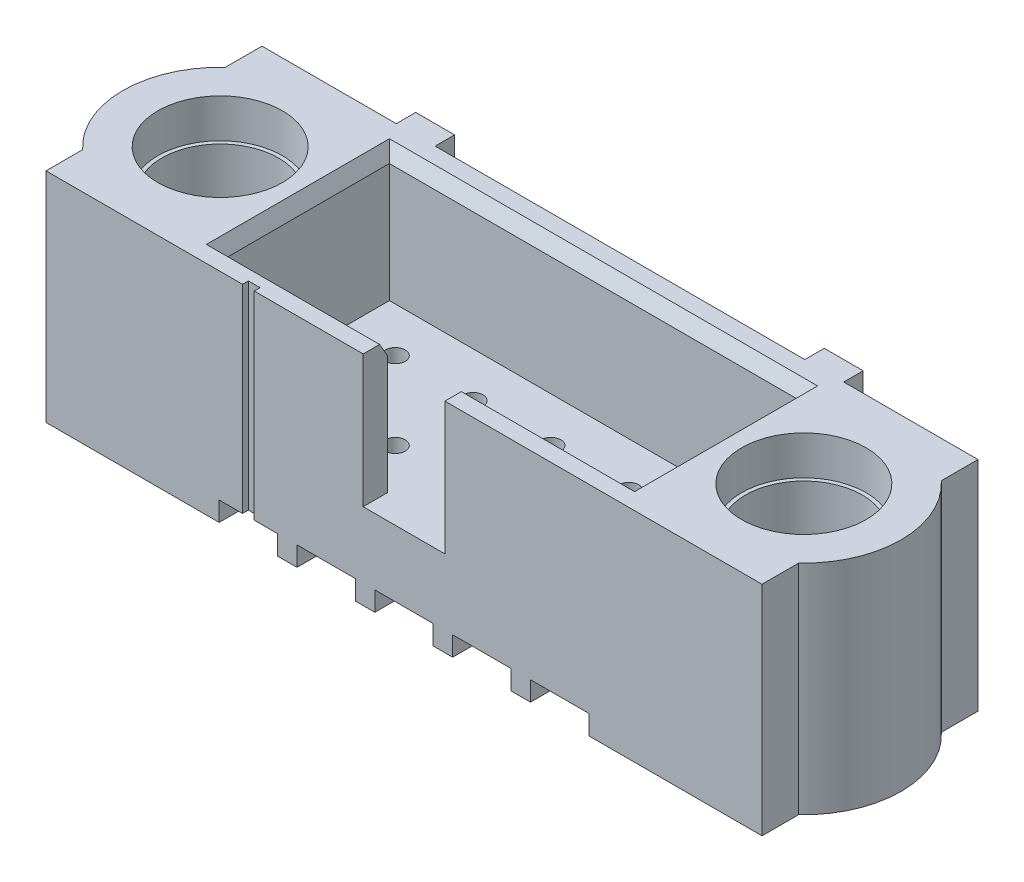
ISO-10303-21;
HEADER;
FILE_DESCRIPTION(('STEP AP214'),'2;1');
FILE_NAME('part.step','',(''),(''),'','','');
FILE_SCHEMA(('AUTOMOTIVE_DESIGN { 1 0 10303 214 1 1 1 1 }'));
ENDSEC;
DATA;
#1=APPLICATION_CONTEXT('core data for automotive mechanical design processes');
#2=APPLICATION_PROTOCOL_DEFINITION('international standard','automotive_design',2000,#1);
#3=PRODUCT_CONTEXT('',#1,'mechanical');
#4=PRODUCT('Part','Part','',(#3));
#5=PRODUCT_RELATED_PRODUCT_CATEGORY('part','',(#4));
#6=PRODUCT_DEFINITION_FORMATION('','',#4);
#7=PRODUCT_DEFINITION_CONTEXT('part definition',#1,'design');
#8=PRODUCT_DEFINITION('design','',#6,#7);
#9=PRODUCT_DEFINITION_SHAPE('','',#8);
#10=(LENGTH_UNIT() NAMED_UNIT(*) SI_UNIT(.MILLI.,.METRE.));
#11=(NAMED_UNIT(*) PLANE_ANGLE_UNIT() SI_UNIT($,.RADIAN.));
#12=(NAMED_UNIT(*) SI_UNIT($,.STERADIAN.) SOLID_ANGLE_UNIT());
#13=UNCERTAINTY_MEASURE_WITH_UNIT(LENGTH_MEASURE(1.E-05),#10,'distance_accuracy_value','');
#14=(GEOMETRIC_REPRESENTATION_CONTEXT(3) GLOBAL_UNCERTAINTY_ASSIGNED_CONTEXT((#13)) GLOBAL_UNIT_ASSIGNED_CONTEXT((#10,
#11,#12)) REPRESENTATION_CONTEXT('',''));
#15=CARTESIAN_POINT('',(0.,0.,0.));
#16=DIRECTION('',(0.,0.,1.));
#17=DIRECTION('',(1.,0.,0.));
#18=AXIS2_PLACEMENT_3D('',#15,#16,#17);
#19=CARTESIAN_POINT('',(-0.75,-2.2,2.775));
#20=DIRECTION('',(0.,-1.,0.));
#21=DIRECTION('',(0.,0.,-1.));
#22=AXIS2_PLACEMENT_3D('',#19,#20,#21);
#23=PLANE('',#22);
#24=DIRECTION('',(0.,0.,-1.));
#25=VECTOR('',#24,1.);
#26=CARTESIAN_POINT('',(-0.75,-2.2,2.775));
#27=LINE('',#26,#25);
#28=CARTESIAN_POINT('',(-0.75,-2.2,2.775));
#29=VERTEX_POINT('',#28);
#30=CARTESIAN_POINT('',(-0.75,-2.2,-2.775));
#31=VERTEX_POINT('',#30);
#32=EDGE_CURVE('E549',#29,#31,#27,.T.);
#33=ORIENTED_EDGE('',*,*,#32,.F.);
#34=DIRECTION('',(1.,0.,0.));
#35=VECTOR('',#34,1.);
#36=CARTESIAN_POINT('',(-0.75,-2.2,2.775));
#37=LINE('',#36,#35);
#38=CARTESIAN_POINT('',(-1.25,-2.2,2.775));
#39=VERTEX_POINT('',#38);
#40=EDGE_CURVE('E592',#29,#39,#37,.F.);
#41=ORIENTED_EDGE('',*,*,#40,.T.);
#42=DIRECTION('',(0.,0.,1.));
#43=VECTOR('',#42,1.);
#44=CARTESIAN_POINT('',(-1.25,-2.2,2.775));
#45=LINE('',#44,#43);
#46=CARTESIAN_POINT('',(-1.25,-2.2,-2.775));
#47=VERTEX_POINT('',#46);
#48=EDGE_CURVE('E574',#47,#39,#45,.T.);
#49=ORIENTED_EDGE('',*,*,#48,.F.);
#50=DIRECTION('',(1.,0.,0.));
#51=VECTOR('',#50,1.);
#52=CARTESIAN_POINT('',(-0.75,-2.2,-2.775));
#53=LINE('',#52,#51);
#54=EDGE_CURVE('E594',#47,#31,#53,.T.);
#55=ORIENTED_EDGE('',*,*,#54,.T.);
#56=EDGE_LOOP('',(#33,#41,#49,#55));
#57=FACE_BOUND('',#56,.T.);
#58=ADVANCED_FACE('F16',(#57),#23,.T.);
#59=CARTESIAN_POINT('',(1.25,-2.2,2.775));
#60=DIRECTION('',(0.,-1.,0.));
#61=DIRECTION('',(0.,0.,-1.));
#62=AXIS2_PLACEMENT_3D('',#59,#60,#61);
#63=PLANE('',#62);
#64=DIRECTION('',(0.,0.,-1.));
#65=VECTOR('',#64,1.);
#66=CARTESIAN_POINT('',(1.25,-2.2,2.775));
#67=LINE('',#66,#65);
#68=CARTESIAN_POINT('',(1.25,-2.2,2.775));
#69=VERTEX_POINT('',#68);
#70=CARTESIAN_POINT('',(1.25,-2.2,-2.775));
#71=VERTEX_POINT('',#70);
#72=EDGE_CURVE('E532',#69,#71,#67,.T.);
#73=ORIENTED_EDGE('',*,*,#72,.F.);
#74=DIRECTION('',(1.,0.,0.));
#75=VECTOR('',#74,1.);
#76=CARTESIAN_POINT('',(1.25,-2.2,2.775));
#77=LINE('',#76,#75);
#78=CARTESIAN_POINT('',(0.75,-2.2,2.775));
#79=VERTEX_POINT('',#78);
#80=EDGE_CURVE('E588',#69,#79,#77,.F.);
#81=ORIENTED_EDGE('',*,*,#80,.T.);
#82=DIRECTION('',(0.,0.,1.));
#83=VECTOR('',#82,1.);
#84=CARTESIAN_POINT('',(0.75,-2.2,2.775));
#85=LINE('',#84,#83);
#86=CARTESIAN_POINT('',(0.75,-2.2,-2.775));
#87=VERTEX_POINT('',#86);
#88=EDGE_CURVE('E557',#87,#79,#85,.T.);
#89=ORIENTED_EDGE('',*,*,#88,.F.);
#90=DIRECTION('',(1.,0.,0.));
#91=VECTOR('',#90,1.);
#92=CARTESIAN_POINT('',(1.25,-2.2,-2.775));
#93=LINE('',#92,#91);
#94=EDGE_CURVE('E590',#87,#71,#93,.T.);
#95=ORIENTED_EDGE('',*,*,#94,.T.);
#96=EDGE_LOOP('',(#73,#81,#89,#95));
#97=FACE_BOUND('',#96,.T.);
#98=ADVANCED_FACE('F1550',(#97),#63,.T.);
#99=CARTESIAN_POINT('',(-2.75,-2.2,2.775));
#100=DIRECTION('',(0.,-1.,0.));
#101=DIRECTION('',(0.,0.,-1.));
#102=AXIS2_PLACEMENT_3D('',#99,#100,#101);
#103=PLANE('',#102);
#104=DIRECTION('',(0.,0.,-1.));
#105=VECTOR('',#104,1.);
#106=CARTESIAN_POINT('',(-2.75,-2.2,2.775));
#107=LINE('',#106,#105);
#108=CARTESIAN_POINT('',(-2.75,-2.2,2.775));
#109=VERTEX_POINT('',#108);
#110=CARTESIAN_POINT('',(-2.75,-2.2,-2.775));
#111=VERTEX_POINT('',#110);
#112=EDGE_CURVE('E566',#109,#111,#107,.T.);
#113=ORIENTED_EDGE('',*,*,#112,.F.);
#114=DIRECTION('',(1.,0.,0.));
#115=VECTOR('',#114,1.);
#116=CARTESIAN_POINT('',(-2.75,-2.2,2.775));
#117=LINE('',#116,#115);
#118=CARTESIAN_POINT('',(-3.25,-2.2,2.775));
#119=VERTEX_POINT('',#118);
#120=EDGE_CURVE('E584',#109,#119,#117,.F.);
#121=ORIENTED_EDGE('',*,*,#120,.T.);
#122=DIRECTION('',(0.,0.,1.));
#123=VECTOR('',#122,1.);
#124=CARTESIAN_POINT('',(-3.25,-2.2,2.775));
#125=LINE('',#124,#123);
#126=CARTESIAN_POINT('',(-3.25,-2.2,-2.775));
#127=VERTEX_POINT('',#126);
#128=EDGE_CURVE('E510',#127,#119,#125,.T.);
#129=ORIENTED_EDGE('',*,*,#128,.F.);
#130=DIRECTION('',(1.,0.,0.));
#131=VECTOR('',#130,1.);
#132=CARTESIAN_POINT('',(-2.75,-2.2,-2.775));
#133=LINE('',#132,#131);
#134=EDGE_CURVE('E586',#127,#111,#133,.T.);
#135=ORIENTED_EDGE('',*,*,#134,.T.);
#136=EDGE_LOOP('',(#113,#121,#129,#135));
#137=FACE_BOUND('',#136,.T.);
#138=ADVANCED_FACE('F1547',(#137),#103,.T.);
#139=CARTESIAN_POINT('',(3.25,-2.2,2.775));
#140=DIRECTION('',(0.,-1.,0.));
#141=DIRECTION('',(0.,0.,-1.));
#142=AXIS2_PLACEMENT_3D('',#139,#140,#141);
#143=PLANE('',#142);
#144=DIRECTION('',(0.,0.,-1.));
#145=VECTOR('',#144,1.);
#146=CARTESIAN_POINT('',(3.25,-2.2,2.775));
#147=LINE('',#146,#145);
#148=CARTESIAN_POINT('',(3.25,-2.2,2.775));
#149=VERTEX_POINT('',#148);
#150=CARTESIAN_POINT('',(3.25,-2.2,-2.775));
#151=VERTEX_POINT('',#150);
#152=EDGE_CURVE('E501',#149,#151,#147,.T.);
#153=ORIENTED_EDGE('',*,*,#152,.F.);
#154=DIRECTION('',(1.,0.,0.));
#155=VECTOR('',#154,1.);
#156=CARTESIAN_POINT('',(3.25,-2.2,2.775));
#157=LINE('',#156,#155);
#158=CARTESIAN_POINT('',(2.75,-2.2,2.775));
#159=VERTEX_POINT('',#158);
#160=EDGE_CURVE('E580',#149,#159,#157,.F.);
#161=ORIENTED_EDGE('',*,*,#160,.T.);
#162=DIRECTION('',(0.,0.,1.));
#163=VECTOR('',#162,1.);
#164=CARTESIAN_POINT('',(2.75,-2.2,2.775));
#165=LINE('',#164,#163);
#166=CARTESIAN_POINT('',(2.75,-2.2,-2.775));
#167=VERTEX_POINT('',#166);
#168=EDGE_CURVE('E540',#167,#159,#165,.T.);
#169=ORIENTED_EDGE('',*,*,#168,.F.);
#170=DIRECTION('',(1.,0.,0.));
#171=VECTOR('',#170,1.);
#172=CARTESIAN_POINT('',(3.25,-2.2,-2.775));
#173=LINE('',#172,#171);
#174=EDGE_CURVE('E582',#167,#151,#173,.T.);
#175=ORIENTED_EDGE('',*,*,#174,.T.);
#176=EDGE_LOOP('',(#153,#161,#169,#175));
#177=FACE_BOUND('',#176,.T.);
#178=ADVANCED_FACE('F1543',(#177),#143,.T.);
#179=CARTESIAN_POINT('',(-1.25,-2.2,2.775));
#180=DIRECTION('',(-1.,0.,0.));
#181=DIRECTION('',(0.,0.,1.));
#182=AXIS2_PLACEMENT_3D('',#179,#180,#181);
#183=PLANE('',#182);
#184=DIRECTION('',(0.,1.,0.));
#185=VECTOR('',#184,1.);
#186=CARTESIAN_POINT('',(-1.25,-2.2,2.775));
#187=LINE('',#186,#185);
#188=CARTESIAN_POINT('',(-1.25,-1.7,2.775));
#189=VERTEX_POINT('',#188);
#190=EDGE_CURVE('E572',#39,#189,#187,.T.);
#191=ORIENTED_EDGE('',*,*,#190,.T.);
#192=DIRECTION('',(0.,0.,1.));
#193=VECTOR('',#192,1.);
#194=CARTESIAN_POINT('',(-1.25,-1.7,3.38));
#195=LINE('',#194,#193);
#196=CARTESIAN_POINT('',(-1.25,-1.7,-2.775));
#197=VERTEX_POINT('',#196);
#198=EDGE_CURVE('E496',#189,#197,#195,.F.);
#199=ORIENTED_EDGE('',*,*,#198,.T.);
#200=DIRECTION('',(0.,1.,0.));
#201=VECTOR('',#200,1.);
#202=CARTESIAN_POINT('',(-1.25,-2.2,-2.775));
#203=LINE('',#202,#201);
#204=EDGE_CURVE('E577',#197,#47,#203,.F.);
#205=ORIENTED_EDGE('',*,*,#204,.T.);
#206=ORIENTED_EDGE('',*,*,#48,.T.);
#207=EDGE_LOOP('',(#191,#199,#205,#206));
#208=FACE_BOUND('',#207,.T.);
#209=ADVANCED_FACE('F1539',(#208),#183,.T.);
#210=CARTESIAN_POINT('',(-2.75,-1.7,2.775));
#211=DIRECTION('',(1.,0.,0.));
#212=DIRECTION('',(0.,0.,-1.));
#213=AXIS2_PLACEMENT_3D('',#210,#211,#212);
#214=PLANE('',#213);
#215=DIRECTION('',(0.,1.,0.));
#216=VECTOR('',#215,1.);
#217=CARTESIAN_POINT('',(-2.75,-1.7,-2.775));
#218=LINE('',#217,#216);
#219=CARTESIAN_POINT('',(-2.75,-1.7,-2.775));
#220=VERTEX_POINT('',#219);
#221=EDGE_CURVE('E563',#111,#220,#218,.T.);
#222=ORIENTED_EDGE('',*,*,#221,.T.);
#223=DIRECTION('',(0.,0.,1.));
#224=VECTOR('',#223,1.);
#225=CARTESIAN_POINT('',(-2.75,-1.7,3.38));
#226=LINE('',#225,#224);
#227=CARTESIAN_POINT('',(-2.75,-1.7,2.775));
#228=VERTEX_POINT('',#227);
#229=EDGE_CURVE('E491',#220,#228,#226,.T.);
#230=ORIENTED_EDGE('',*,*,#229,.T.);
#231=DIRECTION('',(0.,1.,0.));
#232=VECTOR('',#231,1.);
#233=CARTESIAN_POINT('',(-2.75,-1.7,2.775));
#234=LINE('',#233,#232);
#235=EDGE_CURVE('E569',#228,#109,#234,.F.);
#236=ORIENTED_EDGE('',*,*,#235,.T.);
#237=ORIENTED_EDGE('',*,*,#112,.T.);
#238=EDGE_LOOP('',(#222,#230,#236,#237));
#239=FACE_BOUND('',#238,.T.);
#240=ADVANCED_FACE('F1535',(#239),#214,.T.);
#241=CARTESIAN_POINT('',(0.75,-2.2,2.775));
#242=DIRECTION('',(-1.,0.,0.));
#243=DIRECTION('',(0.,0.,1.));
#244=AXIS2_PLACEMENT_3D('',#241,#242,#243);
#245=PLANE('',#244);
#246=DIRECTION('',(0.,1.,0.));
#247=VECTOR('',#246,1.);
#248=CARTESIAN_POINT('',(0.75,-2.2,2.775));
#249=LINE('',#248,#247);
#250=CARTESIAN_POINT('',(0.75,-1.7,2.775));
#251=VERTEX_POINT('',#250);
#252=EDGE_CURVE('E555',#79,#251,#249,.T.);
#253=ORIENTED_EDGE('',*,*,#252,.T.);
#254=DIRECTION('',(0.,0.,1.));
#255=VECTOR('',#254,1.);
#256=CARTESIAN_POINT('',(0.75,-1.7,3.38));
#257=LINE('',#256,#255);
#258=CARTESIAN_POINT('',(0.75,-1.7,-2.775));
#259=VERTEX_POINT('',#258);
#260=EDGE_CURVE('E485',#251,#259,#257,.F.);
#261=ORIENTED_EDGE('',*,*,#260,.T.);
#262=DIRECTION('',(0.,1.,0.));
#263=VECTOR('',#262,1.);
#264=CARTESIAN_POINT('',(0.75,-2.2,-2.775));
#265=LINE('',#264,#263);
#266=EDGE_CURVE('E560',#259,#87,#265,.F.);
#267=ORIENTED_EDGE('',*,*,#266,.T.);
#268=ORIENTED_EDGE('',*,*,#88,.T.);
#269=EDGE_LOOP('',(#253,#261,#267,#268));
#270=FACE_BOUND('',#269,.T.);
#271=ADVANCED_FACE('F1531',(#270),#245,.T.);
#272=CARTESIAN_POINT('',(-0.75,-1.7,2.775));
#273=DIRECTION('',(1.,0.,0.));
#274=DIRECTION('',(0.,0.,-1.));
#275=AXIS2_PLACEMENT_3D('',#272,#273,#274);
#276=PLANE('',#275);
#277=DIRECTION('',(0.,1.,0.));
#278=VECTOR('',#277,1.);
#279=CARTESIAN_POINT('',(-0.75,-1.7,-2.775));
#280=LINE('',#279,#278);
#281=CARTESIAN_POINT('',(-0.75,-1.7,-2.775));
#282=VERTEX_POINT('',#281);
#283=EDGE_CURVE('E546',#31,#282,#280,.T.);
#284=ORIENTED_EDGE('',*,*,#283,.T.);
#285=DIRECTION('',(0.,0.,1.));
#286=VECTOR('',#285,1.);
#287=CARTESIAN_POINT('',(-0.75,-1.7,3.38));
#288=LINE('',#287,#286);
#289=CARTESIAN_POINT('',(-0.75,-1.7,2.775));
#290=VERTEX_POINT('',#289);
#291=EDGE_CURVE('E480',#282,#290,#288,.T.);
#292=ORIENTED_EDGE('',*,*,#291,.T.);
#293=DIRECTION('',(0.,1.,0.));
#294=VECTOR('',#293,1.);
#295=CARTESIAN_POINT('',(-0.75,-1.7,2.775));
#296=LINE('',#295,#294);
#297=EDGE_CURVE('E552',#290,#29,#296,.F.);
#298=ORIENTED_EDGE('',*,*,#297,.T.);
#299=ORIENTED_EDGE('',*,*,#32,.T.);
#300=EDGE_LOOP('',(#284,#292,#298,#299));
#301=FACE_BOUND('',#300,.T.);
#302=ADVANCED_FACE('F1527',(#301),#276,.T.);
#303=CARTESIAN_POINT('',(2.75,-2.2,2.775));
#304=DIRECTION('',(-1.,0.,0.));
#305=DIRECTION('',(0.,0.,1.));
#306=AXIS2_PLACEMENT_3D('',#303,#304,#305);
#307=PLANE('',#306);
#308=DIRECTION('',(0.,1.,0.));
#309=VECTOR('',#308,1.);
#310=CARTESIAN_POINT('',(2.75,-2.2,2.775));
#311=LINE('',#310,#309);
#312=CARTESIAN_POINT('',(2.75,-1.7,2.775));
#313=VERTEX_POINT('',#312);
#314=EDGE_CURVE('E538',#159,#313,#311,.T.);
#315=ORIENTED_EDGE('',*,*,#314,.T.);
#316=DIRECTION('',(0.,0.,1.));
#317=VECTOR('',#316,1.);
#318=CARTESIAN_POINT('',(2.75,-1.7,3.38));
#319=LINE('',#318,#317);
#320=CARTESIAN_POINT('',(2.75,-1.7,-2.775));
#321=VERTEX_POINT('',#320);
#322=EDGE_CURVE('E474',#313,#321,#319,.F.);
#323=ORIENTED_EDGE('',*,*,#322,.T.);
#324=DIRECTION('',(0.,1.,0.));
#325=VECTOR('',#324,1.);
#326=CARTESIAN_POINT('',(2.75,-2.2,-2.775));
#327=LINE('',#326,#325);
#328=EDGE_CURVE('E543',#321,#167,#327,.F.);
#329=ORIENTED_EDGE('',*,*,#328,.T.);
#330=ORIENTED_EDGE('',*,*,#168,.T.);
#331=EDGE_LOOP('',(#315,#323,#329,#330));
#332=FACE_BOUND('',#331,.T.);
#333=ADVANCED_FACE('F1523',(#332),#307,.T.);
#334=CARTESIAN_POINT('',(1.25,-1.7,2.775));
#335=DIRECTION('',(1.,0.,0.));
#336=DIRECTION('',(0.,0.,-1.));
#337=AXIS2_PLACEMENT_3D('',#334,#335,#336);
#338=PLANE('',#337);
#339=DIRECTION('',(0.,1.,0.));
#340=VECTOR('',#339,1.);
#341=CARTESIAN_POINT('',(1.25,-1.7,-2.775));
#342=LINE('',#341,#340);
#343=CARTESIAN_POINT('',(1.25,-1.7,-2.775));
#344=VERTEX_POINT('',#343);
#345=EDGE_CURVE('E516',#71,#344,#342,.T.);
#346=ORIENTED_EDGE('',*,*,#345,.T.);
#347=DIRECTION('',(0.,0.,1.));
#348=VECTOR('',#347,1.);
#349=CARTESIAN_POINT('',(1.25,-1.7,3.38));
#350=LINE('',#349,#348);
#351=CARTESIAN_POINT('',(1.25,-1.7,2.775));
#352=VERTEX_POINT('',#351);
#353=EDGE_CURVE('E469',#344,#352,#350,.T.);
#354=ORIENTED_EDGE('',*,*,#353,.T.);
#355=DIRECTION('',(0.,1.,0.));
#356=VECTOR('',#355,1.);
#357=CARTESIAN_POINT('',(1.25,-1.7,2.775));
#358=LINE('',#357,#356);
#359=EDGE_CURVE('E535',#352,#69,#358,.F.);
#360=ORIENTED_EDGE('',*,*,#359,.T.);
#361=ORIENTED_EDGE('',*,*,#72,.T.);
#362=EDGE_LOOP('',(#346,#354,#360,#361));
#363=FACE_BOUND('',#362,.T.);
#364=ADVANCED_FACE('F1519',(#363),#338,.T.);
#365=CARTESIAN_POINT('',(-3.25,-2.2,2.775));
#366=DIRECTION('',(-1.,0.,0.));
#367=DIRECTION('',(0.,0.,1.));
#368=AXIS2_PLACEMENT_3D('',#365,#366,#367);
#369=PLANE('',#368);
#370=DIRECTION('',(0.,1.,0.));
#371=VECTOR('',#370,1.);
#372=CARTESIAN_POINT('',(-3.25,-2.2,2.775));
#373=LINE('',#372,#371);
#374=CARTESIAN_POINT('',(-3.25,-1.7,2.775));
#375=VERTEX_POINT('',#374);
#376=EDGE_CURVE('E507',#119,#375,#373,.T.);
#377=ORIENTED_EDGE('',*,*,#376,.T.);
#378=DIRECTION('',(0.,0.,1.));
#379=VECTOR('',#378,1.);
#380=CARTESIAN_POINT('',(-3.25,-1.7,3.38));
#381=LINE('',#380,#379);
#382=CARTESIAN_POINT('',(-3.25,-1.7,-2.775));
#383=VERTEX_POINT('',#382);
#384=EDGE_CURVE('E877',#375,#383,#381,.F.);
#385=ORIENTED_EDGE('',*,*,#384,.T.);
#386=DIRECTION('',(0.,1.,0.));
#387=VECTOR('',#386,1.);
#388=CARTESIAN_POINT('',(-3.25,-2.2,-2.775));
#389=LINE('',#388,#387);
#390=EDGE_CURVE('E513',#383,#127,#389,.F.);
#391=ORIENTED_EDGE('',*,*,#390,.T.);
#392=ORIENTED_EDGE('',*,*,#128,.T.);
#393=EDGE_LOOP('',(#377,#385,#391,#392));
#394=FACE_BOUND('',#393,.T.);
#395=ADVANCED_FACE('F1515',(#394),#369,.T.);
#396=CARTESIAN_POINT('',(0.,-1.4,0.));
#397=DIRECTION('',(0.,1.,0.));
#398=DIRECTION('',(0.,0.,1.));
#399=AXIS2_PLACEMENT_3D('',#396,#397,#398);
#400=PLANE('',#399);
#401=CARTESIAN_POINT('',(-7.5,-1.4,0.));
#402=DIRECTION('',(0.,-1.,0.));
#403=DIRECTION('',(0.,0.,-1.));
#404=AXIS2_PLACEMENT_3D('',#401,#402,#403);
#405=CIRCLE('',#404,1.5);
#406=CARTESIAN_POINT('',(-7.5,-1.4,-1.5));
#407=VERTEX_POINT('',#406);
#408=EDGE_CURVE('E752',#407,#407,#405,.F.);
#409=ORIENTED_EDGE('',*,*,#408,.T.);
#410=EDGE_LOOP('',(#409));
#411=FACE_BOUND('',#410,.T.);
#412=CARTESIAN_POINT('',(-6.05,-1.4,-1.45));
#413=DIRECTION('',(0.,-1.,0.));
#414=DIRECTION('',(0.,0.,-1.));
#415=AXIS2_PLACEMENT_3D('',#412,#413,#414);
#416=CIRCLE('',#415,0.1);
#417=CARTESIAN_POINT('',(-6.05,-1.4,-1.55));
#418=VERTEX_POINT('',#417);
#419=CARTESIAN_POINT('',(-5.95,-1.4,-1.45));
#420=VERTEX_POINT('',#419);
#421=EDGE_CURVE('E523',#418,#420,#416,.T.);
#422=ORIENTED_EDGE('',*,*,#421,.T.);
#423=DIRECTION('',(0.,0.,1.));
#424=VECTOR('',#423,1.);
#425=CARTESIAN_POINT('',(-5.95,-1.4,1.55));
#426=LINE('',#425,#424);
#427=CARTESIAN_POINT('',(-5.95,-1.4,1.45));
#428=VERTEX_POINT('',#427);
#429=EDGE_CURVE('E520',#428,#420,#426,.F.);
#430=ORIENTED_EDGE('',*,*,#429,.F.);
#431=CARTESIAN_POINT('',(-6.05,-1.4,1.45));
#432=DIRECTION('',(0.,-1.,0.));
#433=DIRECTION('',(0.,0.,-1.));
#434=AXIS2_PLACEMENT_3D('',#431,#432,#433);
#435=CIRCLE('',#434,0.1);
#436=CARTESIAN_POINT('',(-6.05,-1.4,1.55));
#437=VERTEX_POINT('',#436);
#438=EDGE_CURVE('E527',#428,#437,#435,.T.);
#439=ORIENTED_EDGE('',*,*,#438,.T.);
#440=DIRECTION('',(-1.,0.,0.));
#441=VECTOR('',#440,1.);
#442=CARTESIAN_POINT('',(-9.05,-1.4,1.55));
#443=LINE('',#442,#441);
#444=CARTESIAN_POINT('',(-8.95,-1.4,1.55));
#445=VERTEX_POINT('',#444);
#446=EDGE_CURVE('E525',#445,#437,#443,.F.);
#447=ORIENTED_EDGE('',*,*,#446,.F.);
#448=CARTESIAN_POINT('',(-8.95,-1.4,1.45));
#449=DIRECTION('',(0.,-1.,0.));
#450=DIRECTION('',(0.,0.,-1.));
#451=AXIS2_PLACEMENT_3D('',#448,#449,#450);
#452=CIRCLE('',#451,0.1);
#453=CARTESIAN_POINT('',(-9.05,-1.4,1.45));
#454=VERTEX_POINT('',#453);
#455=EDGE_CURVE('E426',#445,#454,#452,.T.);
#456=ORIENTED_EDGE('',*,*,#455,.T.);
#457=DIRECTION('',(0.,0.,-1.));
#458=VECTOR('',#457,1.);
#459=CARTESIAN_POINT('',(-9.05,-1.4,-1.55));
#460=LINE('',#459,#458);
#461=CARTESIAN_POINT('',(-9.05,-1.4,-1.45));
#462=VERTEX_POINT('',#461);
#463=EDGE_CURVE('E420',#462,#454,#460,.F.);
#464=ORIENTED_EDGE('',*,*,#463,.F.);
#465=CARTESIAN_POINT('',(-8.95,-1.4,-1.45));
#466=DIRECTION('',(0.,-1.,0.));
#467=DIRECTION('',(0.,0.,-1.));
#468=AXIS2_PLACEMENT_3D('',#465,#466,#467);
#469=CIRCLE('',#468,0.1);
#470=CARTESIAN_POINT('',(-8.95,-1.4,-1.55));
#471=VERTEX_POINT('',#470);
#472=EDGE_CURVE('E19',#462,#471,#469,.T.);
#473=ORIENTED_EDGE('',*,*,#472,.T.);
#474=DIRECTION('',(1.,0.,0.));
#475=VECTOR('',#474,1.);
#476=CARTESIAN_POINT('',(-5.95,-1.4,-1.55));
#477=LINE('',#476,#475);
#478=EDGE_CURVE('E517',#418,#471,#477,.F.);
#479=ORIENTED_EDGE('',*,*,#478,.F.);
#480=EDGE_LOOP('',(#422,#430,#439,#447,#456,#464,#473,#479));
#481=FACE_BOUND('',#480,.T.);
#482=ADVANCED_FACE('F422',(#411,#481),#400,.F.);
#483=CARTESIAN_POINT('',(3.25,-1.7,2.775));
#484=DIRECTION('',(1.,0.,0.));
#485=DIRECTION('',(0.,0.,-1.));
#486=AXIS2_PLACEMENT_3D('',#483,#484,#485);
#487=PLANE('',#486);
#488=DIRECTION('',(0.,1.,0.));
#489=VECTOR('',#488,1.);
#490=CARTESIAN_POINT('',(3.25,-1.7,-2.775));
#491=LINE('',#490,#489);
#492=CARTESIAN_POINT('',(3.25,-1.7,-2.775));
#493=VERTEX_POINT('',#492);
#494=EDGE_CURVE('E499',#151,#493,#491,.T.);
#495=ORIENTED_EDGE('',*,*,#494,.T.);
#496=DIRECTION('',(0.,0.,1.));
#497=VECTOR('',#496,1.);
#498=CARTESIAN_POINT('',(3.25,-1.7,3.38));
#499=LINE('',#498,#497);
#500=CARTESIAN_POINT('',(3.25,-1.7,2.775));
#501=VERTEX_POINT('',#500);
#502=EDGE_CURVE('E755',#493,#501,#499,.T.);
#503=ORIENTED_EDGE('',*,*,#502,.T.);
#504=DIRECTION('',(0.,1.,0.));
#505=VECTOR('',#504,1.);
#506=CARTESIAN_POINT('',(3.25,-1.7,2.775));
#507=LINE('',#506,#505);
#508=EDGE_CURVE('E504',#501,#149,#507,.F.);
#509=ORIENTED_EDGE('',*,*,#508,.T.);
#510=ORIENTED_EDGE('',*,*,#152,.T.);
#511=EDGE_LOOP('',(#495,#503,#509,#510));
#512=FACE_BOUND('',#511,.T.);
#513=ADVANCED_FACE('F1508',(#512),#487,.T.);
#514=CARTESIAN_POINT('',(4.75,-1.7,3.38));
#515=DIRECTION('',(0.,1.,0.));
#516=DIRECTION('',(0.,0.,1.));
#517=AXIS2_PLACEMENT_3D('',#514,#515,#516);
#518=PLANE('',#517);
#519=CARTESIAN_POINT('',(-2.,-1.70000000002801,1.));
#520=DIRECTION('',(0.,-1.,0.));
#521=DIRECTION('',(0.,0.,-1.));
#522=AXIS2_PLACEMENT_3D('',#519,#520,#521);
#523=CIRCLE('',#522,0.434999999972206);
#524=CARTESIAN_POINT('',(-2.,-1.70000000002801,0.565000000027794));
#525=VERTEX_POINT('',#524);
#526=EDGE_CURVE('E727',#525,#525,#523,.F.);
#527=ORIENTED_EDGE('',*,*,#526,.T.);
#528=EDGE_LOOP('',(#527));
#529=FACE_BOUND('',#528,.T.);
#530=CARTESIAN_POINT('',(-2.,-1.70000000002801,-1.));
#531=DIRECTION('',(0.,-1.,0.));
#532=DIRECTION('',(0.,0.,-1.));
#533=AXIS2_PLACEMENT_3D('',#530,#531,#532);
#534=CIRCLE('',#533,0.434999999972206);
#535=CARTESIAN_POINT('',(-2.,-1.70000000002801,-1.43499999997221));
#536=VERTEX_POINT('',#535);
#537=EDGE_CURVE('E739',#536,#536,#534,.F.);
#538=ORIENTED_EDGE('',*,*,#537,.T.);
#539=EDGE_LOOP('',(#538));
#540=FACE_BOUND('',#539,.T.);
#541=ORIENTED_EDGE('',*,*,#229,.F.);
#542=DIRECTION('',(1.,0.,0.));
#543=VECTOR('',#542,1.);
#544=CARTESIAN_POINT('',(4.75,-1.7,-2.775));
#545=LINE('',#544,#543);
#546=EDGE_CURVE('E494',#197,#220,#545,.F.);
#547=ORIENTED_EDGE('',*,*,#546,.F.);
#548=ORIENTED_EDGE('',*,*,#198,.F.);
#549=DIRECTION('',(1.,0.,0.));
#550=VECTOR('',#549,1.);
#551=CARTESIAN_POINT('',(4.75,-1.7,2.775));
#552=LINE('',#551,#550);
#553=EDGE_CURVE('E488',#228,#189,#552,.T.);
#554=ORIENTED_EDGE('',*,*,#553,.F.);
#555=EDGE_LOOP('',(#541,#547,#548,#554));
#556=FACE_BOUND('',#555,.T.);
#557=ADVANCED_FACE('F1504',(#529,#540,#556),#518,.F.);
#558=CARTESIAN_POINT('',(4.75,-1.7,3.38));
#559=DIRECTION('',(0.,1.,0.));
#560=DIRECTION('',(0.,0.,1.));
#561=AXIS2_PLACEMENT_3D('',#558,#559,#560);
#562=PLANE('',#561);
#563=CARTESIAN_POINT('',(0.,-1.70000000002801,1.));
#564=DIRECTION('',(0.,-1.,0.));
#565=DIRECTION('',(0.,0.,-1.));
#566=AXIS2_PLACEMENT_3D('',#563,#564,#565);
#567=CIRCLE('',#566,0.435000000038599);
#568=CARTESIAN_POINT('',(0.,-1.70000000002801,0.564999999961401));
#569=VERTEX_POINT('',#568);
#570=EDGE_CURVE('E724',#569,#569,#567,.F.);
#571=ORIENTED_EDGE('',*,*,#570,.T.);
#572=EDGE_LOOP('',(#571));
#573=FACE_BOUND('',#572,.T.);
#574=CARTESIAN_POINT('',(0.,-1.70000000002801,-1.));
#575=DIRECTION('',(0.,-1.,0.));
#576=DIRECTION('',(0.,0.,-1.));
#577=AXIS2_PLACEMENT_3D('',#574,#575,#576);
#578=CIRCLE('',#577,0.435000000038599);
#579=CARTESIAN_POINT('',(0.,-1.70000000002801,-1.4350000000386));
#580=VERTEX_POINT('',#579);
#581=EDGE_CURVE('E742',#580,#580,#578,.F.);
#582=ORIENTED_EDGE('',*,*,#581,.T.);
#583=EDGE_LOOP('',(#582));
#584=FACE_BOUND('',#583,.T.);
#585=ORIENTED_EDGE('',*,*,#291,.F.);
#586=DIRECTION('',(1.,0.,0.));
#587=VECTOR('',#586,1.);
#588=CARTESIAN_POINT('',(4.75,-1.7,-2.775));
#589=LINE('',#588,#587);
#590=EDGE_CURVE('E483',#259,#282,#589,.F.);
#591=ORIENTED_EDGE('',*,*,#590,.F.);
#592=ORIENTED_EDGE('',*,*,#260,.F.);
#593=DIRECTION('',(1.,0.,0.));
#594=VECTOR('',#593,1.);
#595=CARTESIAN_POINT('',(4.75,-1.7,2.775));
#596=LINE('',#595,#594);
#597=EDGE_CURVE('E477',#290,#251,#596,.T.);
#598=ORIENTED_EDGE('',*,*,#597,.F.);
#599=EDGE_LOOP('',(#585,#591,#592,#598));
#600=FACE_BOUND('',#599,.T.);
#601=ADVANCED_FACE('F1500',(#573,#584,#600),#562,.F.);
#602=CARTESIAN_POINT('',(4.75,-1.7,3.38));
#603=DIRECTION('',(0.,1.,0.));
#604=DIRECTION('',(0.,0.,1.));
#605=AXIS2_PLACEMENT_3D('',#602,#603,#604);
#606=PLANE('',#605);
#607=CARTESIAN_POINT('',(2.,-1.70000000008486,1.));
#608=DIRECTION('',(0.,-1.,0.));
#609=DIRECTION('',(0.,0.,-1.));
#610=AXIS2_PLACEMENT_3D('',#607,#608,#609);
#611=CIRCLE('',#610,0.434999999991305);
#612=CARTESIAN_POINT('',(2.,-1.70000000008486,0.565000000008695));
#613=VERTEX_POINT('',#612);
#614=EDGE_CURVE('E721',#613,#613,#611,.F.);
#615=ORIENTED_EDGE('',*,*,#614,.T.);
#616=EDGE_LOOP('',(#615));
#617=FACE_BOUND('',#616,.T.);
#618=CARTESIAN_POINT('',(2.,-1.70000000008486,-1.));
#619=DIRECTION('',(0.,-1.,0.));
#620=DIRECTION('',(0.,0.,-1.));
#621=AXIS2_PLACEMENT_3D('',#618,#619,#620);
#622=CIRCLE('',#621,0.434999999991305);
#623=CARTESIAN_POINT('',(2.,-1.70000000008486,-1.43499999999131));
#624=VERTEX_POINT('',#623);
#625=EDGE_CURVE('E745',#624,#624,#622,.F.);
#626=ORIENTED_EDGE('',*,*,#625,.T.);
#627=EDGE_LOOP('',(#626));
#628=FACE_BOUND('',#627,.T.);
#629=ORIENTED_EDGE('',*,*,#353,.F.);
#630=DIRECTION('',(1.,0.,0.));
#631=VECTOR('',#630,1.);
#632=CARTESIAN_POINT('',(4.75,-1.7,-2.775));
#633=LINE('',#632,#631);
#634=EDGE_CURVE('E472',#321,#344,#633,.F.);
#635=ORIENTED_EDGE('',*,*,#634,.F.);
#636=ORIENTED_EDGE('',*,*,#322,.F.);
#637=DIRECTION('',(1.,0.,0.));
#638=VECTOR('',#637,1.);
#639=CARTESIAN_POINT('',(4.75,-1.7,2.775));
#640=LINE('',#639,#638);
#641=EDGE_CURVE('E438',#352,#313,#640,.T.);
#642=ORIENTED_EDGE('',*,*,#641,.F.);
#643=EDGE_LOOP('',(#629,#635,#636,#642));
#644=FACE_BOUND('',#643,.T.);
#645=ADVANCED_FACE('F1497',(#617,#628,#644),#606,.F.);
#646=CARTESIAN_POINT('',(-8.95,-1.369474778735,-1.45));
#647=DIRECTION('',(0.,-1.,0.));
#648=DIRECTION('',(0.,0.,-1.));
#649=AXIS2_PLACEMENT_3D('',#646,#647,#648);
#650=CYLINDRICAL_SURFACE('',#649,0.1);
#651=DIRECTION('',(0.,1.,0.));
#652=VECTOR('',#651,1.);
#653=CARTESIAN_POINT('',(-8.95,-2.2,-1.55));
#654=LINE('',#653,#652);
#655=CARTESIAN_POINT('',(-8.95,-2.2,-1.55));
#656=VERTEX_POINT('',#655);
#657=EDGE_CURVE('E436',#471,#656,#654,.F.);
#658=ORIENTED_EDGE('',*,*,#657,.F.);
#659=ORIENTED_EDGE('',*,*,#472,.F.);
#660=DIRECTION('',(0.,1.,0.));
#661=VECTOR('',#660,1.);
#662=CARTESIAN_POINT('',(-9.05,-2.2,-1.45));
#663=LINE('',#662,#661);
#664=CARTESIAN_POINT('',(-9.05,-2.2,-1.45));
#665=VERTEX_POINT('',#664);
#666=EDGE_CURVE('E430',#665,#462,#663,.T.);
#667=ORIENTED_EDGE('',*,*,#666,.F.);
#668=CARTESIAN_POINT('',(-8.95,-2.2,-1.45));
#669=DIRECTION('',(0.,-1.,0.));
#670=DIRECTION('',(0.,0.,-1.));
#671=AXIS2_PLACEMENT_3D('',#668,#669,#670);
#672=CIRCLE('',#671,0.1);
#673=EDGE_CURVE('E714',#656,#665,#672,.F.);
#674=ORIENTED_EDGE('',*,*,#673,.F.);
#675=EDGE_LOOP('',(#658,#659,#667,#674));
#676=FACE_BOUND('',#675,.T.);
#677=ADVANCED_FACE('F433',(#676),#650,.F.);
#678=CARTESIAN_POINT('',(-9.05,-2.2,-1.55));
#679=DIRECTION('',(1.,0.,0.));
#680=DIRECTION('',(0.,0.,-1.));
#681=AXIS2_PLACEMENT_3D('',#678,#679,#680);
#682=PLANE('',#681);
#683=DIRECTION('',(0.,0.,-1.));
#684=VECTOR('',#683,1.);
#685=CARTESIAN_POINT('',(-9.05,-2.2,0.));
#686=LINE('',#685,#684);
#687=CARTESIAN_POINT('',(-9.05,-2.2,1.45));
#688=VERTEX_POINT('',#687);
#689=EDGE_CURVE('E441',#665,#688,#686,.F.);
#690=ORIENTED_EDGE('',*,*,#689,.F.);
#691=ORIENTED_EDGE('',*,*,#666,.T.);
#692=ORIENTED_EDGE('',*,*,#463,.T.);
#693=DIRECTION('',(0.,-1.,0.));
#694=VECTOR('',#693,1.);
#695=CARTESIAN_POINT('',(-9.05,-1.369474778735,1.45));
#696=LINE('',#695,#694);
#697=EDGE_CURVE('E444',#454,#688,#696,.T.);
#698=ORIENTED_EDGE('',*,*,#697,.T.);
#699=EDGE_LOOP('',(#690,#691,#692,#698));
#700=FACE_BOUND('',#699,.T.);
#701=ADVANCED_FACE('F439',(#700),#682,.T.);
#702=CARTESIAN_POINT('',(-8.95,-1.369474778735,1.45));
#703=DIRECTION('',(0.,-1.,0.));
#704=DIRECTION('',(0.,0.,-1.));
#705=AXIS2_PLACEMENT_3D('',#702,#703,#704);
#706=CYLINDRICAL_SURFACE('',#705,0.1);
#707=ORIENTED_EDGE('',*,*,#697,.F.);
#708=ORIENTED_EDGE('',*,*,#455,.F.);
#709=DIRECTION('',(0.,1.,0.));
#710=VECTOR('',#709,1.);
#711=CARTESIAN_POINT('',(-8.95,-2.2,1.55));
#712=LINE('',#711,#710);
#713=CARTESIAN_POINT('',(-8.95,-2.2,1.55));
#714=VERTEX_POINT('',#713);
#715=EDGE_CURVE('E528',#714,#445,#712,.T.);
#716=ORIENTED_EDGE('',*,*,#715,.F.);
#717=CARTESIAN_POINT('',(-8.95,-2.2,1.45));
#718=DIRECTION('',(0.,-1.,0.));
#719=DIRECTION('',(0.,0.,-1.));
#720=AXIS2_PLACEMENT_3D('',#717,#718,#719);
#721=CIRCLE('',#720,0.1);
#722=EDGE_CURVE('E711',#688,#714,#721,.F.);
#723=ORIENTED_EDGE('',*,*,#722,.F.);
#724=EDGE_LOOP('',(#707,#708,#716,#723));
#725=FACE_BOUND('',#724,.T.);
#726=ADVANCED_FACE('F772',(#725),#706,.F.);
#727=CARTESIAN_POINT('',(-9.05,-2.2,1.55));
#728=DIRECTION('',(0.,0.,-1.));
#729=DIRECTION('',(-1.,0.,0.));
#730=AXIS2_PLACEMENT_3D('',#727,#728,#729);
#731=PLANE('',#730);
#732=ORIENTED_EDGE('',*,*,#446,.T.);
#733=DIRECTION('',(0.,-1.,0.));
#734=VECTOR('',#733,1.);
#735=CARTESIAN_POINT('',(-6.05,-1.369474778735,1.55));
#736=LINE('',#735,#734);
#737=CARTESIAN_POINT('',(-6.05,-2.2,1.55));
#738=VERTEX_POINT('',#737);
#739=EDGE_CURVE('E759',#437,#738,#736,.T.);
#740=ORIENTED_EDGE('',*,*,#739,.T.);
#741=DIRECTION('',(1.,0.,0.));
#742=VECTOR('',#741,1.);
#743=CARTESIAN_POINT('',(0.,-2.2,1.55));
#744=LINE('',#743,#742);
#745=EDGE_CURVE('E710',#714,#738,#744,.T.);
#746=ORIENTED_EDGE('',*,*,#745,.F.);
#747=ORIENTED_EDGE('',*,*,#715,.T.);
#748=EDGE_LOOP('',(#732,#740,#746,#747));
#749=FACE_BOUND('',#748,.T.);
#750=ADVANCED_FACE('F1487',(#749),#731,.T.);
#751=CARTESIAN_POINT('',(-6.05,-1.369474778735,1.45));
#752=DIRECTION('',(0.,-1.,0.));
#753=DIRECTION('',(0.,0.,-1.));
#754=AXIS2_PLACEMENT_3D('',#751,#752,#753);
#755=CYLINDRICAL_SURFACE('',#754,0.1);
#756=ORIENTED_EDGE('',*,*,#739,.F.);
#757=ORIENTED_EDGE('',*,*,#438,.F.);
#758=DIRECTION('',(0.,1.,0.));
#759=VECTOR('',#758,1.);
#760=CARTESIAN_POINT('',(-5.95,-2.2,1.45));
#761=LINE('',#760,#759);
#762=CARTESIAN_POINT('',(-5.95,-2.2,1.45));
#763=VERTEX_POINT('',#762);
#764=EDGE_CURVE('E524',#763,#428,#761,.T.);
#765=ORIENTED_EDGE('',*,*,#764,.F.);
#766=CARTESIAN_POINT('',(-6.05,-2.2,1.45));
#767=DIRECTION('',(0.,-1.,0.));
#768=DIRECTION('',(0.,0.,-1.));
#769=AXIS2_PLACEMENT_3D('',#766,#767,#768);
#770=CIRCLE('',#769,0.1);
#771=EDGE_CURVE('E707',#738,#763,#770,.F.);
#772=ORIENTED_EDGE('',*,*,#771,.F.);
#773=EDGE_LOOP('',(#756,#757,#765,#772));
#774=FACE_BOUND('',#773,.T.);
#775=ADVANCED_FACE('F1484',(#774),#755,.F.);
#776=CARTESIAN_POINT('',(-5.95,-2.2,1.55));
#777=DIRECTION('',(-1.,0.,0.));
#778=DIRECTION('',(0.,0.,1.));
#779=AXIS2_PLACEMENT_3D('',#776,#777,#778);
#780=PLANE('',#779);
#781=ORIENTED_EDGE('',*,*,#429,.T.);
#782=DIRECTION('',(0.,-1.,0.));
#783=VECTOR('',#782,1.);
#784=CARTESIAN_POINT('',(-5.95,-1.369474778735,-1.45));
#785=LINE('',#784,#783);
#786=CARTESIAN_POINT('',(-5.95,-2.2,-1.45));
#787=VERTEX_POINT('',#786);
#788=EDGE_CURVE('E758',#420,#787,#785,.T.);
#789=ORIENTED_EDGE('',*,*,#788,.T.);
#790=DIRECTION('',(0.,0.,-1.));
#791=VECTOR('',#790,1.);
#792=CARTESIAN_POINT('',(-5.95,-2.2,0.));
#793=LINE('',#792,#791);
#794=EDGE_CURVE('E706',#763,#787,#793,.T.);
#795=ORIENTED_EDGE('',*,*,#794,.F.);
#796=ORIENTED_EDGE('',*,*,#764,.T.);
#797=EDGE_LOOP('',(#781,#789,#795,#796));
#798=FACE_BOUND('',#797,.T.);
#799=ADVANCED_FACE('F907',(#798),#780,.T.);
#800=CARTESIAN_POINT('',(-6.05,-1.369474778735,-1.45));
#801=DIRECTION('',(0.,-1.,0.));
#802=DIRECTION('',(0.,0.,-1.));
#803=AXIS2_PLACEMENT_3D('',#800,#801,#802);
#804=CYLINDRICAL_SURFACE('',#803,0.1);
#805=ORIENTED_EDGE('',*,*,#788,.F.);
#806=ORIENTED_EDGE('',*,*,#421,.F.);
#807=DIRECTION('',(0.,1.,0.));
#808=VECTOR('',#807,1.);
#809=CARTESIAN_POINT('',(-6.05,-2.2,-1.55));
#810=LINE('',#809,#808);
#811=CARTESIAN_POINT('',(-6.05,-2.2,-1.55));
#812=VERTEX_POINT('',#811);
#813=EDGE_CURVE('E519',#812,#418,#810,.T.);
#814=ORIENTED_EDGE('',*,*,#813,.F.);
#815=CARTESIAN_POINT('',(-6.05,-2.2,-1.45));
#816=DIRECTION('',(0.,-1.,0.));
#817=DIRECTION('',(0.,0.,-1.));
#818=AXIS2_PLACEMENT_3D('',#815,#816,#817);
#819=CIRCLE('',#818,0.1);
#820=EDGE_CURVE('E702',#787,#812,#819,.F.);
#821=ORIENTED_EDGE('',*,*,#820,.F.);
#822=EDGE_LOOP('',(#805,#806,#814,#821));
#823=FACE_BOUND('',#822,.T.);
#824=ADVANCED_FACE('F910',(#823),#804,.F.);
#825=CARTESIAN_POINT('',(-5.95,-2.2,-1.55));
#826=DIRECTION('',(0.,0.,1.));
#827=DIRECTION('',(1.,0.,0.));
#828=AXIS2_PLACEMENT_3D('',#825,#826,#827);
#829=PLANE('',#828);
#830=ORIENTED_EDGE('',*,*,#478,.T.);
#831=ORIENTED_EDGE('',*,*,#657,.T.);
#832=DIRECTION('',(1.,0.,0.));
#833=VECTOR('',#832,1.);
#834=CARTESIAN_POINT('',(0.,-2.2,-1.55));
#835=LINE('',#834,#833);
#836=EDGE_CURVE('E705',#812,#656,#835,.F.);
#837=ORIENTED_EDGE('',*,*,#836,.F.);
#838=ORIENTED_EDGE('',*,*,#813,.T.);
#839=EDGE_LOOP('',(#830,#831,#837,#838));
#840=FACE_BOUND('',#839,.T.);
#841=ADVANCED_FACE('F1476',(#840),#829,.T.);
#842=CARTESIAN_POINT('',(-5.75,3.4,-3.275));
#843=DIRECTION('',(0.,0.,-1.));
#844=DIRECTION('',(-1.,0.,0.));
#845=AXIS2_PLACEMENT_3D('',#842,#843,#844);
#846=PLANE('',#845);
#847=DIRECTION('',(0.,1.,0.));
#848=VECTOR('',#847,1.);
#849=CARTESIAN_POINT('',(-5.75,3.4,-3.275));
#850=LINE('',#849,#848);
#851=CARTESIAN_POINT('',(-5.75,3.4,-3.275));
#852=VERTEX_POINT('',#851);
#853=CARTESIAN_POINT('',(-5.75,-2.2,-3.275));
#854=VERTEX_POINT('',#853);
#855=EDGE_CURVE('E916',#852,#854,#850,.F.);
#856=ORIENTED_EDGE('',*,*,#855,.F.);
#857=DIRECTION('',(-1.,0.,0.));
#858=VECTOR('',#857,1.);
#859=CARTESIAN_POINT('',(-5.75,3.4,-3.275));
#860=LINE('',#859,#858);
#861=CARTESIAN_POINT('',(-4.75,3.4,-3.275));
#862=VERTEX_POINT('',#861);
#863=EDGE_CURVE('E884',#852,#862,#860,.F.);
#864=ORIENTED_EDGE('',*,*,#863,.T.);
#865=DIRECTION('',(0.,1.,0.));
#866=VECTOR('',#865,1.);
#867=CARTESIAN_POINT('',(-4.75,3.4,-3.275));
#868=LINE('',#867,#866);
#869=CARTESIAN_POINT('',(-4.75,-2.2,-3.275));
#870=VERTEX_POINT('',#869);
#871=EDGE_CURVE('E922',#870,#862,#868,.T.);
#872=ORIENTED_EDGE('',*,*,#871,.F.);
#873=DIRECTION('',(1.,0.,0.));
#874=VECTOR('',#873,1.);
#875=CARTESIAN_POINT('',(0.,-2.2,-3.275));
#876=LINE('',#875,#874);
#877=EDGE_CURVE('E716',#854,#870,#876,.T.);
#878=ORIENTED_EDGE('',*,*,#877,.F.);
#879=EDGE_LOOP('',(#856,#864,#872,#878));
#880=FACE_BOUND('',#879,.T.);
#881=ADVANCED_FACE('F1206',(#880),#846,.T.);
#882=CARTESIAN_POINT('',(4.75,-1.7,3.38));
#883=DIRECTION('',(0.,1.,0.));
#884=DIRECTION('',(0.,0.,1.));
#885=AXIS2_PLACEMENT_3D('',#882,#883,#884);
#886=PLANE('',#885);
#887=CARTESIAN_POINT('',(-4.,-1.70000000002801,1.));
#888=DIRECTION('',(0.,-1.,0.));
#889=DIRECTION('',(0.,0.,-1.));
#890=AXIS2_PLACEMENT_3D('',#887,#888,#889);
#891=CIRCLE('',#890,0.4350000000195);
#892=CARTESIAN_POINT('',(-4.,-1.70000000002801,0.5649999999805));
#893=VERTEX_POINT('',#892);
#894=EDGE_CURVE('E730',#893,#893,#891,.F.);
#895=ORIENTED_EDGE('',*,*,#894,.T.);
#896=EDGE_LOOP('',(#895));
#897=FACE_BOUND('',#896,.T.);
#898=CARTESIAN_POINT('',(-4.,-1.70000000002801,-1.));
#899=DIRECTION('',(0.,-1.,0.));
#900=DIRECTION('',(0.,0.,-1.));
#901=AXIS2_PLACEMENT_3D('',#898,#899,#900);
#902=CIRCLE('',#901,0.4350000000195);
#903=CARTESIAN_POINT('',(-4.,-1.70000000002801,-1.4350000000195));
#904=VERTEX_POINT('',#903);
#905=EDGE_CURVE('E733',#904,#904,#902,.F.);
#906=ORIENTED_EDGE('',*,*,#905,.T.);
#907=EDGE_LOOP('',(#906));
#908=FACE_BOUND('',#907,.T.);
#909=DIRECTION('',(0.,0.,1.));
#910=VECTOR('',#909,1.);
#911=CARTESIAN_POINT('',(-4.15,-1.7,3.38));
#912=LINE('',#911,#910);
#913=CARTESIAN_POINT('',(-4.15,-1.7,2.775));
#914=VERTEX_POINT('',#913);
#915=CARTESIAN_POINT('',(-4.15,-1.7,2.625));
#916=VERTEX_POINT('',#915);
#917=EDGE_CURVE('E871',#914,#916,#912,.F.);
#918=ORIENTED_EDGE('',*,*,#917,.F.);
#919=DIRECTION('',(1.,0.,0.));
#920=VECTOR('',#919,1.);
#921=CARTESIAN_POINT('',(4.75,-1.7,2.775));
#922=LINE('',#921,#920);
#923=CARTESIAN_POINT('',(-4.75,-1.7,2.775));
#924=VERTEX_POINT('',#923);
#925=EDGE_CURVE('E873',#924,#914,#922,.T.);
#926=ORIENTED_EDGE('',*,*,#925,.F.);
#927=DIRECTION('',(0.,0.,-1.));
#928=VECTOR('',#927,1.);
#929=CARTESIAN_POINT('',(-4.75,-1.7,-3.275));
#930=LINE('',#929,#928);
#931=CARTESIAN_POINT('',(-4.75,-1.7,-2.775));
#932=VERTEX_POINT('',#931);
#933=EDGE_CURVE('E927',#932,#924,#930,.F.);
#934=ORIENTED_EDGE('',*,*,#933,.F.);
#935=DIRECTION('',(1.,0.,0.));
#936=VECTOR('',#935,1.);
#937=CARTESIAN_POINT('',(4.75,-1.7,-2.775));
#938=LINE('',#937,#936);
#939=EDGE_CURVE('E875',#383,#932,#938,.F.);
#940=ORIENTED_EDGE('',*,*,#939,.F.);
#941=ORIENTED_EDGE('',*,*,#384,.F.);
#942=DIRECTION('',(1.,0.,0.));
#943=VECTOR('',#942,1.);
#944=CARTESIAN_POINT('',(4.75,-1.7,2.775));
#945=LINE('',#944,#943);
#946=CARTESIAN_POINT('',(-3.85,-1.7,2.775));
#947=VERTEX_POINT('',#946);
#948=EDGE_CURVE('E880',#947,#375,#945,.T.);
#949=ORIENTED_EDGE('',*,*,#948,.F.);
#950=DIRECTION('',(0.,0.,1.));
#951=VECTOR('',#950,1.);
#952=CARTESIAN_POINT('',(-3.85,-1.7,3.38));
#953=LINE('',#952,#951);
#954=CARTESIAN_POINT('',(-3.85,-1.7,2.625));
#955=VERTEX_POINT('',#954);
#956=EDGE_CURVE('E882',#955,#947,#953,.T.);
#957=ORIENTED_EDGE('',*,*,#956,.F.);
#958=DIRECTION('',(1.,0.,0.));
#959=VECTOR('',#958,1.);
#960=CARTESIAN_POINT('',(4.75,-1.7,2.625));
#961=LINE('',#960,#959);
#962=EDGE_CURVE('E756',#916,#955,#961,.T.);
#963=ORIENTED_EDGE('',*,*,#962,.F.);
#964=EDGE_LOOP('',(#918,#926,#934,#940,#941,#949,#957,#963));
#965=FACE_BOUND('',#964,.T.);
#966=ADVANCED_FACE('F1237',(#897,#908,#965),#886,.F.);
#967=CARTESIAN_POINT('',(-7.5,3.4,0.));
#968=DIRECTION('',(0.,-1.,0.));
#969=DIRECTION('',(0.,0.,-1.));
#970=AXIS2_PLACEMENT_3D('',#967,#968,#969);
#971=CYLINDRICAL_SURFACE('',#970,1.5);
#972=ORIENTED_EDGE('',*,*,#408,.F.);
#973=EDGE_LOOP('',(#972));
#974=FACE_BOUND('',#973,.T.);
#975=CARTESIAN_POINT('',(-7.5,2.4,0.));
#976=DIRECTION('',(0.,-1.,0.));
#977=DIRECTION('',(0.,0.,-1.));
#978=AXIS2_PLACEMENT_3D('',#975,#976,#977);
#979=CIRCLE('',#978,1.5);
#980=CARTESIAN_POINT('',(-7.5,2.4,-1.5));
#981=VERTEX_POINT('',#980);
#982=EDGE_CURVE('E698',#981,#981,#979,.T.);
#983=ORIENTED_EDGE('',*,*,#982,.F.);
#984=EDGE_LOOP('',(#983));
#985=FACE_BOUND('',#984,.T.);
#986=ADVANCED_FACE('F1466',(#974,#985),#971,.F.);
#987=CARTESIAN_POINT('',(7.5,3.4,0.));
#988=DIRECTION('',(0.,-1.,0.));
#989=DIRECTION('',(0.,0.,-1.));
#990=AXIS2_PLACEMENT_3D('',#987,#988,#989);
#991=CYLINDRICAL_SURFACE('',#990,1.5);
#992=CARTESIAN_POINT('',(7.5,-1.4,0.));
#993=DIRECTION('',(0.,-1.,0.));
#994=DIRECTION('',(0.,0.,-1.));
#995=AXIS2_PLACEMENT_3D('',#992,#993,#994);
#996=CIRCLE('',#995,1.5);
#997=CARTESIAN_POINT('',(7.5,-1.4,-1.5));
#998=VERTEX_POINT('',#997);
#999=EDGE_CURVE('E748',#998,#998,#996,.F.);
#1000=ORIENTED_EDGE('',*,*,#999,.F.);
#1001=EDGE_LOOP('',(#1000));
#1002=FACE_BOUND('',#1001,.T.);
#1003=CARTESIAN_POINT('',(7.5,2.4,0.));
#1004=DIRECTION('',(0.,-1.,0.));
#1005=DIRECTION('',(0.,0.,-1.));
#1006=AXIS2_PLACEMENT_3D('',#1003,#1004,#1005);
#1007=CIRCLE('',#1006,1.5);
#1008=CARTESIAN_POINT('',(7.5,2.4,-1.5));
#1009=VERTEX_POINT('',#1008);
#1010=EDGE_CURVE('E694',#1009,#1009,#1007,.F.);
#1011=ORIENTED_EDGE('',*,*,#1010,.T.);
#1012=EDGE_LOOP('',(#1011));
#1013=FACE_BOUND('',#1012,.T.);
#1014=ADVANCED_FACE('F1462',(#1002,#1013),#991,.F.);
#1015=CARTESIAN_POINT('',(4.75,-1.7,3.38));
#1016=DIRECTION('',(0.,1.,0.));
#1017=DIRECTION('',(0.,0.,1.));
#1018=AXIS2_PLACEMENT_3D('',#1015,#1016,#1017);
#1019=PLANE('',#1018);
#1020=CARTESIAN_POINT('',(4.,-1.70000000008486,1.));
#1021=DIRECTION('',(0.,-1.,0.));
#1022=DIRECTION('',(0.,0.,-1.));
#1023=AXIS2_PLACEMENT_3D('',#1020,#1021,#1022);
#1024=CIRCLE('',#1023,0.435000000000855);
#1025=CARTESIAN_POINT('',(4.,-1.70000000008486,0.564999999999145));
#1026=VERTEX_POINT('',#1025);
#1027=EDGE_CURVE('E717',#1026,#1026,#1024,.F.);
#1028=ORIENTED_EDGE('',*,*,#1027,.T.);
#1029=EDGE_LOOP('',(#1028));
#1030=FACE_BOUND('',#1029,.T.);
#1031=CARTESIAN_POINT('',(4.,-1.70000000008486,-1.));
#1032=DIRECTION('',(0.,-1.,0.));
#1033=DIRECTION('',(0.,0.,-1.));
#1034=AXIS2_PLACEMENT_3D('',#1031,#1032,#1033);
#1035=CIRCLE('',#1034,0.435000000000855);
#1036=CARTESIAN_POINT('',(4.,-1.70000000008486,-1.43500000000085));
#1037=VERTEX_POINT('',#1036);
#1038=EDGE_CURVE('E736',#1037,#1037,#1035,.F.);
#1039=ORIENTED_EDGE('',*,*,#1038,.T.);
#1040=EDGE_LOOP('',(#1039));
#1041=FACE_BOUND('',#1040,.T.);
#1042=DIRECTION('',(0.,0.,-1.));
#1043=VECTOR('',#1042,1.);
#1044=CARTESIAN_POINT('',(4.75,-1.7,-3.275));
#1045=LINE('',#1044,#1043);
#1046=CARTESIAN_POINT('',(4.75,-1.7,-2.775));
#1047=VERTEX_POINT('',#1046);
#1048=CARTESIAN_POINT('',(4.75,-1.7,2.775));
#1049=VERTEX_POINT('',#1048);
#1050=EDGE_CURVE('E948',#1047,#1049,#1045,.F.);
#1051=ORIENTED_EDGE('',*,*,#1050,.T.);
#1052=DIRECTION('',(1.,0.,0.));
#1053=VECTOR('',#1052,1.);
#1054=CARTESIAN_POINT('',(4.75,-1.7,2.775));
#1055=LINE('',#1054,#1053);
#1056=EDGE_CURVE('E850',#501,#1049,#1055,.T.);
#1057=ORIENTED_EDGE('',*,*,#1056,.F.);
#1058=ORIENTED_EDGE('',*,*,#502,.F.);
#1059=DIRECTION('',(1.,0.,0.));
#1060=VECTOR('',#1059,1.);
#1061=CARTESIAN_POINT('',(4.75,-1.7,-2.775));
#1062=LINE('',#1061,#1060);
#1063=EDGE_CURVE('E847',#1047,#493,#1062,.F.);
#1064=ORIENTED_EDGE('',*,*,#1063,.F.);
#1065=EDGE_LOOP('',(#1051,#1057,#1058,#1064));
#1066=FACE_BOUND('',#1065,.T.);
#1067=ADVANCED_FACE('F1459',(#1030,#1041,#1066),#1019,.F.);
#1068=CARTESIAN_POINT('',(5.75,3.4,-3.275));
#1069=DIRECTION('',(0.,0.,1.));
#1070=DIRECTION('',(1.,0.,0.));
#1071=AXIS2_PLACEMENT_3D('',#1068,#1069,#1070);
#1072=PLANE('',#1071);
#1073=DIRECTION('',(1.,0.,0.));
#1074=VECTOR('',#1073,1.);
#1075=CARTESIAN_POINT('',(5.75,-2.2,-3.275));
#1076=LINE('',#1075,#1074);
#1077=CARTESIAN_POINT('',(4.75,-2.2,-3.275));
#1078=VERTEX_POINT('',#1077);
#1079=CARTESIAN_POINT('',(5.75,-2.2,-3.275));
#1080=VERTEX_POINT('',#1079);
#1081=EDGE_CURVE('E751',#1078,#1080,#1076,.T.);
#1082=ORIENTED_EDGE('',*,*,#1081,.F.);
#1083=DIRECTION('',(0.,1.,0.));
#1084=VECTOR('',#1083,1.);
#1085=CARTESIAN_POINT('',(4.75,3.4,-3.275));
#1086=LINE('',#1085,#1084);
#1087=CARTESIAN_POINT('',(4.75,3.4,-3.275));
#1088=VERTEX_POINT('',#1087);
#1089=EDGE_CURVE('E953',#1078,#1088,#1086,.T.);
#1090=ORIENTED_EDGE('',*,*,#1089,.T.);
#1091=DIRECTION('',(1.,0.,0.));
#1092=VECTOR('',#1091,1.);
#1093=CARTESIAN_POINT('',(5.75,3.4,-3.275));
#1094=LINE('',#1093,#1092);
#1095=CARTESIAN_POINT('',(5.75,3.4,-3.275));
#1096=VERTEX_POINT('',#1095);
#1097=EDGE_CURVE('E845',#1096,#1088,#1094,.F.);
#1098=ORIENTED_EDGE('',*,*,#1097,.F.);
#1099=DIRECTION('',(0.,1.,0.));
#1100=VECTOR('',#1099,1.);
#1101=CARTESIAN_POINT('',(5.75,3.4,-3.275));
#1102=LINE('',#1101,#1100);
#1103=EDGE_CURVE('E935',#1096,#1080,#1102,.F.);
#1104=ORIENTED_EDGE('',*,*,#1103,.T.);
#1105=EDGE_LOOP('',(#1082,#1090,#1098,#1104));
#1106=FACE_BOUND('',#1105,.T.);
#1107=ADVANCED_FACE('F1186',(#1106),#1072,.F.);
#1108=CARTESIAN_POINT('',(0.,-1.4,0.));
#1109=DIRECTION('',(0.,-1.,0.));
#1110=DIRECTION('',(0.,0.,-1.));
#1111=AXIS2_PLACEMENT_3D('',#1108,#1109,#1110);
#1112=PLANE('',#1111);
#1113=ORIENTED_EDGE('',*,*,#999,.T.);
#1114=EDGE_LOOP('',(#1113));
#1115=FACE_BOUND('',#1114,.T.);
#1116=DIRECTION('',(-1.,0.,0.));
#1117=VECTOR('',#1116,1.);
#1118=CARTESIAN_POINT('',(5.95,-1.4,-1.55));
#1119=LINE('',#1118,#1117);
#1120=CARTESIAN_POINT('',(6.05,-1.4,-1.55));
#1121=VERTEX_POINT('',#1120);
#1122=CARTESIAN_POINT('',(8.95,-1.4,-1.55));
#1123=VERTEX_POINT('',#1122);
#1124=EDGE_CURVE('E836',#1121,#1123,#1119,.F.);
#1125=ORIENTED_EDGE('',*,*,#1124,.T.);
#1126=CARTESIAN_POINT('',(8.95,-1.4,-1.45));
#1127=DIRECTION('',(0.,1.,0.));
#1128=DIRECTION('',(0.,0.,1.));
#1129=AXIS2_PLACEMENT_3D('',#1126,#1127,#1128);
#1130=CIRCLE('',#1129,0.1);
#1131=CARTESIAN_POINT('',(9.05,-1.4,-1.45));
#1132=VERTEX_POINT('',#1131);
#1133=EDGE_CURVE('E680',#1123,#1132,#1130,.F.);
#1134=ORIENTED_EDGE('',*,*,#1133,.T.);
#1135=DIRECTION('',(0.,0.,-1.));
#1136=VECTOR('',#1135,1.);
#1137=CARTESIAN_POINT('',(9.05,-1.4,-1.55));
#1138=LINE('',#1137,#1136);
#1139=CARTESIAN_POINT('',(9.05,-1.4,1.45));
#1140=VERTEX_POINT('',#1139);
#1141=EDGE_CURVE('E688',#1132,#1140,#1138,.F.);
#1142=ORIENTED_EDGE('',*,*,#1141,.T.);
#1143=CARTESIAN_POINT('',(8.95,-1.4,1.45));
#1144=DIRECTION('',(0.,1.,0.));
#1145=DIRECTION('',(0.,0.,1.));
#1146=AXIS2_PLACEMENT_3D('',#1143,#1144,#1145);
#1147=CIRCLE('',#1146,0.1);
#1148=CARTESIAN_POINT('',(8.95,-1.4,1.55));
#1149=VERTEX_POINT('',#1148);
#1150=EDGE_CURVE('E685',#1140,#1149,#1147,.F.);
#1151=ORIENTED_EDGE('',*,*,#1150,.T.);
#1152=DIRECTION('',(1.,0.,0.));
#1153=VECTOR('',#1152,1.);
#1154=CARTESIAN_POINT('',(9.05,-1.4,1.55));
#1155=LINE('',#1154,#1153);
#1156=CARTESIAN_POINT('',(6.05,-1.4,1.55));
#1157=VERTEX_POINT('',#1156);
#1158=EDGE_CURVE('E841',#1149,#1157,#1155,.F.);
#1159=ORIENTED_EDGE('',*,*,#1158,.T.);
#1160=CARTESIAN_POINT('',(6.05,-1.4,1.45));
#1161=DIRECTION('',(0.,1.,0.));
#1162=DIRECTION('',(0.,0.,1.));
#1163=AXIS2_PLACEMENT_3D('',#1160,#1161,#1162);
#1164=CIRCLE('',#1163,0.1);
#1165=CARTESIAN_POINT('',(5.95,-1.4,1.45));
#1166=VERTEX_POINT('',#1165);
#1167=EDGE_CURVE('E690',#1157,#1166,#1164,.F.);
#1168=ORIENTED_EDGE('',*,*,#1167,.T.);
#1169=DIRECTION('',(0.,0.,1.));
#1170=VECTOR('',#1169,1.);
#1171=CARTESIAN_POINT('',(5.95,-1.4,1.55));
#1172=LINE('',#1171,#1170);
#1173=CARTESIAN_POINT('',(5.95,-1.4,-1.45));
#1174=VERTEX_POINT('',#1173);
#1175=EDGE_CURVE('E831',#1166,#1174,#1172,.F.);
#1176=ORIENTED_EDGE('',*,*,#1175,.T.);
#1177=CARTESIAN_POINT('',(6.05,-1.4,-1.45));
#1178=DIRECTION('',(0.,1.,0.));
#1179=DIRECTION('',(0.,0.,1.));
#1180=AXIS2_PLACEMENT_3D('',#1177,#1178,#1179);
#1181=CIRCLE('',#1180,0.1);
#1182=EDGE_CURVE('E675',#1174,#1121,#1181,.F.);
#1183=ORIENTED_EDGE('',*,*,#1182,.T.);
#1184=EDGE_LOOP('',(#1125,#1134,#1142,#1151,#1159,#1168,#1176,#1183));
#1185=FACE_BOUND('',#1184,.T.);
#1186=ADVANCED_FACE('F1452',(#1115,#1185),#1112,.T.);
#1187=CARTESIAN_POINT('',(2.,-1.70000000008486,-1.));
#1188=DIRECTION('',(0.,-1.,0.));
#1189=DIRECTION('',(0.,0.,-1.));
#1190=AXIS2_PLACEMENT_3D('',#1187,#1188,#1189);
#1191=CONICAL_SURFACE('',#1190,0.434999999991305,0.785398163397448);
#1192=CARTESIAN_POINT('',(2.,-1.52,-1.));
#1193=DIRECTION('',(0.,-1.,0.));
#1194=DIRECTION('',(0.,0.,-1.));
#1195=AXIS2_PLACEMENT_3D('',#1192,#1193,#1194);
#1196=CIRCLE('',#1195,0.255);
#1197=CARTESIAN_POINT('',(2.,-1.52,-1.255));
#1198=VERTEX_POINT('',#1197);
#1199=EDGE_CURVE('E827',#1198,#1198,#1196,.F.);
#1200=ORIENTED_EDGE('',*,*,#1199,.T.);
#1201=EDGE_LOOP('',(#1200));
#1202=FACE_BOUND('',#1201,.T.);
#1203=ORIENTED_EDGE('',*,*,#625,.F.);
#1204=EDGE_LOOP('',(#1203));
#1205=FACE_BOUND('',#1204,.T.);
#1206=ADVANCED_FACE('F1448',(#1202,#1205),#1191,.F.);
#1207=CARTESIAN_POINT('',(0.,-1.70000000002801,-1.));
#1208=DIRECTION('',(0.,-1.,0.));
#1209=DIRECTION('',(0.,0.,-1.));
#1210=AXIS2_PLACEMENT_3D('',#1207,#1208,#1209);
#1211=CONICAL_SURFACE('',#1210,0.435000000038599,0.78539816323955);
#1212=CARTESIAN_POINT('',(0.,-1.52,-1.));
#1213=DIRECTION('',(0.,-1.,0.));
#1214=DIRECTION('',(0.,0.,-1.));
#1215=AXIS2_PLACEMENT_3D('',#1212,#1213,#1214);
#1216=CIRCLE('',#1215,0.255);
#1217=CARTESIAN_POINT('',(0.,-1.52,-1.255));
#1218=VERTEX_POINT('',#1217);
#1219=EDGE_CURVE('E824',#1218,#1218,#1216,.F.);
#1220=ORIENTED_EDGE('',*,*,#1219,.T.);
#1221=EDGE_LOOP('',(#1220));
#1222=FACE_BOUND('',#1221,.T.);
#1223=ORIENTED_EDGE('',*,*,#581,.F.);
#1224=EDGE_LOOP('',(#1223));
#1225=FACE_BOUND('',#1224,.T.);
#1226=ADVANCED_FACE('F1444',(#1222,#1225),#1211,.F.);
#1227=CARTESIAN_POINT('',(-2.,-1.70000000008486,-1.));
#1228=DIRECTION('',(0.,-1.,0.));
#1229=DIRECTION('',(0.,0.,-1.));
#1230=AXIS2_PLACEMENT_3D('',#1227,#1228,#1229);
#1231=CONICAL_SURFACE('',#1230,0.435000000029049,0.785398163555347);
#1232=CARTESIAN_POINT('',(-2.,-1.52,-1.));
#1233=DIRECTION('',(0.,-1.,0.));
#1234=DIRECTION('',(0.,0.,-1.));
#1235=AXIS2_PLACEMENT_3D('',#1232,#1233,#1234);
#1236=CIRCLE('',#1235,0.255);
#1237=CARTESIAN_POINT('',(-2.,-1.52,-1.255));
#1238=VERTEX_POINT('',#1237);
#1239=EDGE_CURVE('E821',#1238,#1238,#1236,.F.);
#1240=ORIENTED_EDGE('',*,*,#1239,.T.);
#1241=EDGE_LOOP('',(#1240));
#1242=FACE_BOUND('',#1241,.T.);
#1243=ORIENTED_EDGE('',*,*,#537,.F.);
#1244=EDGE_LOOP('',(#1243));
#1245=FACE_BOUND('',#1244,.T.);
#1246=ADVANCED_FACE('F1440',(#1242,#1245),#1231,.F.);
#1247=CARTESIAN_POINT('',(4.,-1.70000000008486,-1.));
#1248=DIRECTION('',(0.,-1.,0.));
#1249=DIRECTION('',(0.,0.,-1.));
#1250=AXIS2_PLACEMENT_3D('',#1247,#1248,#1249);
#1251=CONICAL_SURFACE('',#1250,0.435000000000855,0.785398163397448);
#1252=CARTESIAN_POINT('',(4.,-1.52,-1.));
#1253=DIRECTION('',(0.,-1.,0.));
#1254=DIRECTION('',(0.,0.,-1.));
#1255=AXIS2_PLACEMENT_3D('',#1252,#1253,#1254);
#1256=CIRCLE('',#1255,0.255);
#1257=CARTESIAN_POINT('',(4.,-1.52,-1.255));
#1258=VERTEX_POINT('',#1257);
#1259=EDGE_CURVE('E818',#1258,#1258,#1256,.F.);
#1260=ORIENTED_EDGE('',*,*,#1259,.T.);
#1261=EDGE_LOOP('',(#1260));
#1262=FACE_BOUND('',#1261,.T.);
#1263=ORIENTED_EDGE('',*,*,#1038,.F.);
#1264=EDGE_LOOP('',(#1263));
#1265=FACE_BOUND('',#1264,.T.);
#1266=ADVANCED_FACE('F1436',(#1262,#1265),#1251,.F.);
#1267=CARTESIAN_POINT('',(-4.,-1.70000000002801,-1.));
#1268=DIRECTION('',(0.,-1.,0.));
#1269=DIRECTION('',(0.,0.,-1.));
#1270=AXIS2_PLACEMENT_3D('',#1267,#1268,#1269);
#1271=CONICAL_SURFACE('',#1270,0.4350000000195,0.78539816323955);
#1272=CARTESIAN_POINT('',(-4.,-1.52,-1.));
#1273=DIRECTION('',(0.,-1.,0.));
#1274=DIRECTION('',(0.,0.,-1.));
#1275=AXIS2_PLACEMENT_3D('',#1272,#1273,#1274);
#1276=CIRCLE('',#1275,0.255);
#1277=CARTESIAN_POINT('',(-4.,-1.52,-1.255));
#1278=VERTEX_POINT('',#1277);
#1279=EDGE_CURVE('E815',#1278,#1278,#1276,.F.);
#1280=ORIENTED_EDGE('',*,*,#1279,.T.);
#1281=EDGE_LOOP('',(#1280));
#1282=FACE_BOUND('',#1281,.T.);
#1283=ORIENTED_EDGE('',*,*,#905,.F.);
#1284=EDGE_LOOP('',(#1283));
#1285=FACE_BOUND('',#1284,.T.);
#1286=ADVANCED_FACE('F1432',(#1282,#1285),#1271,.F.);
#1287=CARTESIAN_POINT('',(-4.,-1.70000000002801,1.));
#1288=DIRECTION('',(0.,-1.,0.));
#1289=DIRECTION('',(0.,0.,-1.));
#1290=AXIS2_PLACEMENT_3D('',#1287,#1288,#1289);
#1291=CONICAL_SURFACE('',#1290,0.4350000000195,0.78539816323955);
#1292=CARTESIAN_POINT('',(-4.,-1.52,1.));
#1293=DIRECTION('',(0.,-1.,0.));
#1294=DIRECTION('',(0.,0.,-1.));
#1295=AXIS2_PLACEMENT_3D('',#1292,#1293,#1294);
#1296=CIRCLE('',#1295,0.255);
#1297=CARTESIAN_POINT('',(-4.,-1.52,0.745));
#1298=VERTEX_POINT('',#1297);
#1299=EDGE_CURVE('E812',#1298,#1298,#1296,.F.);
#1300=ORIENTED_EDGE('',*,*,#1299,.T.);
#1301=EDGE_LOOP('',(#1300));
#1302=FACE_BOUND('',#1301,.T.);
#1303=ORIENTED_EDGE('',*,*,#894,.F.);
#1304=EDGE_LOOP('',(#1303));
#1305=FACE_BOUND('',#1304,.T.);
#1306=ADVANCED_FACE('F1428',(#1302,#1305),#1291,.F.);
#1307=CARTESIAN_POINT('',(-2.,-1.70000000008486,1.));
#1308=DIRECTION('',(0.,-1.,0.));
#1309=DIRECTION('',(0.,0.,-1.));
#1310=AXIS2_PLACEMENT_3D('',#1307,#1308,#1309);
#1311=CONICAL_SURFACE('',#1310,0.435000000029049,0.785398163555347);
#1312=CARTESIAN_POINT('',(-2.,-1.52,1.));
#1313=DIRECTION('',(0.,-1.,0.));
#1314=DIRECTION('',(0.,0.,-1.));
#1315=AXIS2_PLACEMENT_3D('',#1312,#1313,#1314);
#1316=CIRCLE('',#1315,0.255);
#1317=CARTESIAN_POINT('',(-2.,-1.52,0.745));
#1318=VERTEX_POINT('',#1317);
#1319=EDGE_CURVE('E809',#1318,#1318,#1316,.F.);
#1320=ORIENTED_EDGE('',*,*,#1319,.T.);
#1321=EDGE_LOOP('',(#1320));
#1322=FACE_BOUND('',#1321,.T.);
#1323=ORIENTED_EDGE('',*,*,#526,.F.);
#1324=EDGE_LOOP('',(#1323));
#1325=FACE_BOUND('',#1324,.T.);
#1326=ADVANCED_FACE('F1424',(#1322,#1325),#1311,.F.);
#1327=CARTESIAN_POINT('',(0.,-1.70000000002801,1.));
#1328=DIRECTION('',(0.,-1.,0.));
#1329=DIRECTION('',(0.,0.,-1.));
#1330=AXIS2_PLACEMENT_3D('',#1327,#1328,#1329);
#1331=CONICAL_SURFACE('',#1330,0.435000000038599,0.78539816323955);
#1332=CARTESIAN_POINT('',(0.,-1.52,1.));
#1333=DIRECTION('',(0.,-1.,0.));
#1334=DIRECTION('',(0.,0.,-1.));
#1335=AXIS2_PLACEMENT_3D('',#1332,#1333,#1334);
#1336=CIRCLE('',#1335,0.255);
#1337=CARTESIAN_POINT('',(0.,-1.52,0.745));
#1338=VERTEX_POINT('',#1337);
#1339=EDGE_CURVE('E806',#1338,#1338,#1336,.F.);
#1340=ORIENTED_EDGE('',*,*,#1339,.T.);
#1341=EDGE_LOOP('',(#1340));
#1342=FACE_BOUND('',#1341,.T.);
#1343=ORIENTED_EDGE('',*,*,#570,.F.);
#1344=EDGE_LOOP('',(#1343));
#1345=FACE_BOUND('',#1344,.T.);
#1346=ADVANCED_FACE('F1420',(#1342,#1345),#1331,.F.);
#1347=CARTESIAN_POINT('',(2.,-1.70000000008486,1.));
#1348=DIRECTION('',(0.,-1.,0.));
#1349=DIRECTION('',(0.,0.,-1.));
#1350=AXIS2_PLACEMENT_3D('',#1347,#1348,#1349);
#1351=CONICAL_SURFACE('',#1350,0.434999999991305,0.785398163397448);
#1352=CARTESIAN_POINT('',(2.,-1.52,1.));
#1353=DIRECTION('',(0.,-1.,0.));
#1354=DIRECTION('',(0.,0.,-1.));
#1355=AXIS2_PLACEMENT_3D('',#1352,#1353,#1354);
#1356=CIRCLE('',#1355,0.255);
#1357=CARTESIAN_POINT('',(2.,-1.52,0.745));
#1358=VERTEX_POINT('',#1357);
#1359=EDGE_CURVE('E803',#1358,#1358,#1356,.F.);
#1360=ORIENTED_EDGE('',*,*,#1359,.T.);
#1361=EDGE_LOOP('',(#1360));
#1362=FACE_BOUND('',#1361,.T.);
#1363=ORIENTED_EDGE('',*,*,#614,.F.);
#1364=EDGE_LOOP('',(#1363));
#1365=FACE_BOUND('',#1364,.T.);
#1366=ADVANCED_FACE('F1416',(#1362,#1365),#1351,.F.);
#1367=CARTESIAN_POINT('',(4.,-1.70000000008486,1.));
#1368=DIRECTION('',(0.,-1.,0.));
#1369=DIRECTION('',(0.,0.,-1.));
#1370=AXIS2_PLACEMENT_3D('',#1367,#1368,#1369);
#1371=CONICAL_SURFACE('',#1370,0.435000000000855,0.785398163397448);
#1372=CARTESIAN_POINT('',(4.,-1.52,1.));
#1373=DIRECTION('',(0.,-1.,0.));
#1374=DIRECTION('',(0.,0.,-1.));
#1375=AXIS2_PLACEMENT_3D('',#1372,#1373,#1374);
#1376=CIRCLE('',#1375,0.255);
#1377=CARTESIAN_POINT('',(4.,-1.52,0.745));
#1378=VERTEX_POINT('',#1377);
#1379=EDGE_CURVE('E800',#1378,#1378,#1376,.F.);
#1380=ORIENTED_EDGE('',*,*,#1379,.T.);
#1381=EDGE_LOOP('',(#1380));
#1382=FACE_BOUND('',#1381,.T.);
#1383=ORIENTED_EDGE('',*,*,#1027,.F.);
#1384=EDGE_LOOP('',(#1383));
#1385=FACE_BOUND('',#1384,.T.);
#1386=ADVANCED_FACE('F1413',(#1382,#1385),#1371,.F.);
#1387=CARTESIAN_POINT('',(-9.2,3.4,2.775));
#1388=DIRECTION('',(-1.,0.,0.));
#1389=DIRECTION('',(0.,0.,1.));
#1390=AXIS2_PLACEMENT_3D('',#1387,#1388,#1389);
#1391=PLANE('',#1390);
#1392=DIRECTION('',(0.,1.,0.));
#1393=VECTOR('',#1392,1.);
#1394=CARTESIAN_POINT('',(-9.2,3.4,2.775));
#1395=LINE('',#1394,#1393);
#1396=CARTESIAN_POINT('',(-9.2,3.4,2.775));
#1397=VERTEX_POINT('',#1396);
#1398=CARTESIAN_POINT('',(-9.2,-2.2,2.775));
#1399=VERTEX_POINT('',#1398);
#1400=EDGE_CURVE('E452',#1397,#1399,#1395,.F.);
#1401=ORIENTED_EDGE('',*,*,#1400,.F.);
#1402=DIRECTION('',(0.,0.,1.));
#1403=VECTOR('',#1402,1.);
#1404=CARTESIAN_POINT('',(-9.2,3.4,2.775));
#1405=LINE('',#1404,#1403);
#1406=CARTESIAN_POINT('',(-9.20000000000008,3.4,1.83303027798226));
#1407=VERTEX_POINT('',#1406);
#1408=EDGE_CURVE('E720',#1397,#1407,#1405,.F.);
#1409=ORIENTED_EDGE('',*,*,#1408,.T.);
#1410=DIRECTION('',(0.,-1.,0.));
#1411=VECTOR('',#1410,1.);
#1412=CARTESIAN_POINT('',(-9.20000000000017,3.4,1.83303027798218));
#1413=LINE('',#1412,#1411);
#1414=CARTESIAN_POINT('',(-9.20000000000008,-2.2,1.83303027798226));
#1415=VERTEX_POINT('',#1414);
#1416=EDGE_CURVE('E673',#1415,#1407,#1413,.F.);
#1417=ORIENTED_EDGE('',*,*,#1416,.F.);
#1418=DIRECTION('',(0.,0.,-1.));
#1419=VECTOR('',#1418,1.);
#1420=CARTESIAN_POINT('',(-9.2,-2.2,0.));
#1421=LINE('',#1420,#1419);
#1422=EDGE_CURVE('E784',#1399,#1415,#1421,.T.);
#1423=ORIENTED_EDGE('',*,*,#1422,.F.);
#1424=EDGE_LOOP('',(#1401,#1409,#1417,#1423));
#1425=FACE_BOUND('',#1424,.T.);
#1426=ADVANCED_FACE('F1227',(#1425),#1391,.T.);
#1427=CARTESIAN_POINT('',(0.,-2.2,0.));
#1428=DIRECTION('',(0.,-1.,0.));
#1429=DIRECTION('',(0.,0.,-1.));
#1430=AXIS2_PLACEMENT_3D('',#1427,#1428,#1429);
#1431=PLANE('',#1430);
#1432=ORIENTED_EDGE('',*,*,#820,.T.);
#1433=ORIENTED_EDGE('',*,*,#836,.T.);
#1434=ORIENTED_EDGE('',*,*,#673,.T.);
#1435=ORIENTED_EDGE('',*,*,#689,.T.);
#1436=ORIENTED_EDGE('',*,*,#722,.T.);
#1437=ORIENTED_EDGE('',*,*,#745,.T.);
#1438=ORIENTED_EDGE('',*,*,#771,.T.);
#1439=ORIENTED_EDGE('',*,*,#794,.T.);
#1440=EDGE_LOOP('',(#1432,#1433,#1434,#1435,#1436,#1437,#1438,#1439));
#1441=FACE_BOUND('',#1440,.T.);
#1442=ORIENTED_EDGE('',*,*,#877,.T.);
#1443=DIRECTION('',(0.,0.,-1.));
#1444=VECTOR('',#1443,1.);
#1445=CARTESIAN_POINT('',(-4.75,-2.2,-3.275));
#1446=LINE('',#1445,#1444);
#1447=CARTESIAN_POINT('',(-4.75,-2.2,2.775));
#1448=VERTEX_POINT('',#1447);
#1449=EDGE_CURVE('E930',#1448,#870,#1446,.T.);
#1450=ORIENTED_EDGE('',*,*,#1449,.F.);
#1451=DIRECTION('',(1.,0.,0.));
#1452=VECTOR('',#1451,1.);
#1453=CARTESIAN_POINT('',(9.2,-2.2,2.775));
#1454=LINE('',#1453,#1452);
#1455=EDGE_CURVE('E448',#1399,#1448,#1454,.T.);
#1456=ORIENTED_EDGE('',*,*,#1455,.F.);
#1457=ORIENTED_EDGE('',*,*,#1422,.T.);
#1458=CARTESIAN_POINT('',(-7.5,-2.2,0.));
#1459=DIRECTION('',(0.,-1.,0.));
#1460=DIRECTION('',(0.,0.,-1.));
#1461=AXIS2_PLACEMENT_3D('',#1458,#1459,#1460);
#1462=CIRCLE('',#1461,2.5);
#1463=CARTESIAN_POINT('',(-9.20000000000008,-2.2,-1.83303027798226));
#1464=VERTEX_POINT('',#1463);
#1465=EDGE_CURVE('E670',#1464,#1415,#1462,.F.);
#1466=ORIENTED_EDGE('',*,*,#1465,.F.);
#1467=DIRECTION('',(0.,0.,1.));
#1468=VECTOR('',#1467,1.);
#1469=CARTESIAN_POINT('',(-9.2,-2.2,-1.833030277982));
#1470=LINE('',#1469,#1468);
#1471=CARTESIAN_POINT('',(-9.2,-2.2,-2.775));
#1472=VERTEX_POINT('',#1471);
#1473=EDGE_CURVE('E794',#1472,#1464,#1470,.T.);
#1474=ORIENTED_EDGE('',*,*,#1473,.F.);
#1475=DIRECTION('',(-1.,0.,0.));
#1476=VECTOR('',#1475,1.);
#1477=CARTESIAN_POINT('',(-9.2,-2.2,-2.775));
#1478=LINE('',#1477,#1476);
#1479=CARTESIAN_POINT('',(-5.75,-2.2,-2.775));
#1480=VERTEX_POINT('',#1479);
#1481=EDGE_CURVE('E890',#1480,#1472,#1478,.T.);
#1482=ORIENTED_EDGE('',*,*,#1481,.F.);
#1483=DIRECTION('',(0.,0.,1.));
#1484=VECTOR('',#1483,1.);
#1485=CARTESIAN_POINT('',(-5.75,-2.2,-2.775));
#1486=LINE('',#1485,#1484);
#1487=EDGE_CURVE('E919',#854,#1480,#1486,.T.);
#1488=ORIENTED_EDGE('',*,*,#1487,.F.);
#1489=EDGE_LOOP('',(#1442,#1450,#1456,#1457,#1466,#1474,#1482,#1488));
#1490=FACE_BOUND('',#1489,.T.);
#1491=ADVANCED_FACE('F775',(#1441,#1490),#1431,.T.);
#1492=CARTESIAN_POINT('',(-9.2,3.4,-1.833030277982));
#1493=DIRECTION('',(-1.,0.,0.));
#1494=DIRECTION('',(0.,0.,1.));
#1495=AXIS2_PLACEMENT_3D('',#1492,#1493,#1494);
#1496=PLANE('',#1495);
#1497=DIRECTION('',(0.,-1.,0.));
#1498=VECTOR('',#1497,1.);
#1499=CARTESIAN_POINT('',(-9.20000000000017,3.4,-1.83303027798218));
#1500=LINE('',#1499,#1498);
#1501=CARTESIAN_POINT('',(-9.20000000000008,3.4,-1.83303027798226));
#1502=VERTEX_POINT('',#1501);
#1503=EDGE_CURVE('E674',#1502,#1464,#1500,.T.);
#1504=ORIENTED_EDGE('',*,*,#1503,.F.);
#1505=DIRECTION('',(0.,0.,1.));
#1506=VECTOR('',#1505,1.);
#1507=CARTESIAN_POINT('',(-9.2,3.4,-1.833030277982));
#1508=LINE('',#1507,#1506);
#1509=CARTESIAN_POINT('',(-9.2,3.4,-2.775));
#1510=VERTEX_POINT('',#1509);
#1511=EDGE_CURVE('E791',#1502,#1510,#1508,.F.);
#1512=ORIENTED_EDGE('',*,*,#1511,.T.);
#1513=DIRECTION('',(0.,1.,0.));
#1514=VECTOR('',#1513,1.);
#1515=CARTESIAN_POINT('',(-9.2,3.4,-2.775));
#1516=LINE('',#1515,#1514);
#1517=EDGE_CURVE('E886',#1472,#1510,#1516,.T.);
#1518=ORIENTED_EDGE('',*,*,#1517,.F.);
#1519=ORIENTED_EDGE('',*,*,#1473,.T.);
#1520=EDGE_LOOP('',(#1504,#1512,#1518,#1519));
#1521=FACE_BOUND('',#1520,.T.);
#1522=ADVANCED_FACE('F1219',(#1521),#1496,.T.);
#1523=CARTESIAN_POINT('',(-5.75,3.4,-2.775));
#1524=DIRECTION('',(-1.,0.,0.));
#1525=DIRECTION('',(0.,0.,1.));
#1526=AXIS2_PLACEMENT_3D('',#1523,#1524,#1525);
#1527=PLANE('',#1526);
#1528=ORIENTED_EDGE('',*,*,#1487,.T.);
#1529=DIRECTION('',(0.,1.,0.));
#1530=VECTOR('',#1529,1.);
#1531=CARTESIAN_POINT('',(-5.75,3.4,-2.775));
#1532=LINE('',#1531,#1530);
#1533=CARTESIAN_POINT('',(-5.75,3.4,-2.775));
#1534=VERTEX_POINT('',#1533);
#1535=EDGE_CURVE('E889',#1534,#1480,#1532,.F.);
#1536=ORIENTED_EDGE('',*,*,#1535,.F.);
#1537=DIRECTION('',(0.,0.,1.));
#1538=VECTOR('',#1537,1.);
#1539=CARTESIAN_POINT('',(-5.75,3.4,-2.775));
#1540=LINE('',#1539,#1538);
#1541=EDGE_CURVE('E793',#1534,#852,#1540,.F.);
#1542=ORIENTED_EDGE('',*,*,#1541,.T.);
#1543=ORIENTED_EDGE('',*,*,#855,.T.);
#1544=EDGE_LOOP('',(#1528,#1536,#1542,#1543));
#1545=FACE_BOUND('',#1544,.T.);
#1546=ADVANCED_FACE('F1211',(#1545),#1527,.T.);
#1547=CARTESIAN_POINT('',(-4.75,3.4,-3.275));
#1548=DIRECTION('',(1.,0.,0.));
#1549=DIRECTION('',(0.,0.,-1.));
#1550=AXIS2_PLACEMENT_3D('',#1547,#1548,#1549);
#1551=PLANE('',#1550);
#1552=DIRECTION('',(0.,1.,0.));
#1553=VECTOR('',#1552,1.);
#1554=CARTESIAN_POINT('',(-4.75,3.4,2.775));
#1555=LINE('',#1554,#1553);
#1556=EDGE_CURVE('E451',#1448,#924,#1555,.T.);
#1557=ORIENTED_EDGE('',*,*,#1556,.F.);
#1558=ORIENTED_EDGE('',*,*,#1449,.T.);
#1559=ORIENTED_EDGE('',*,*,#871,.T.);
#1560=DIRECTION('',(0.,0.,-1.));
#1561=VECTOR('',#1560,1.);
#1562=CARTESIAN_POINT('',(-4.75,3.4,-3.275));
#1563=LINE('',#1562,#1561);
#1564=CARTESIAN_POINT('',(-4.75,3.4,-2.775));
#1565=VERTEX_POINT('',#1564);
#1566=EDGE_CURVE('E925',#862,#1565,#1563,.F.);
#1567=ORIENTED_EDGE('',*,*,#1566,.T.);
#1568=DIRECTION('',(0.,1.,0.));
#1569=VECTOR('',#1568,1.);
#1570=CARTESIAN_POINT('',(-4.75,3.4,-2.775));
#1571=LINE('',#1570,#1569);
#1572=EDGE_CURVE('E995',#932,#1565,#1571,.T.);
#1573=ORIENTED_EDGE('',*,*,#1572,.F.);
#1574=ORIENTED_EDGE('',*,*,#933,.T.);
#1575=EDGE_LOOP('',(#1557,#1558,#1559,#1567,#1573,#1574));
#1576=FACE_BOUND('',#1575,.T.);
#1577=ADVANCED_FACE('F1203',(#1576),#1551,.T.);
#1578=CARTESIAN_POINT('',(5.75,3.4,-2.775));
#1579=DIRECTION('',(-1.,0.,0.));
#1580=DIRECTION('',(0.,0.,1.));
#1581=AXIS2_PLACEMENT_3D('',#1578,#1579,#1580);
#1582=PLANE('',#1581);
#1583=ORIENTED_EDGE('',*,*,#1103,.F.);
#1584=DIRECTION('',(0.,0.,1.));
#1585=VECTOR('',#1584,1.);
#1586=CARTESIAN_POINT('',(5.75,3.4,-2.775));
#1587=LINE('',#1586,#1585);
#1588=CARTESIAN_POINT('',(5.75,3.4,-2.775));
#1589=VERTEX_POINT('',#1588);
#1590=EDGE_CURVE('E933',#1589,#1096,#1587,.F.);
#1591=ORIENTED_EDGE('',*,*,#1590,.F.);
#1592=DIRECTION('',(0.,1.,0.));
#1593=VECTOR('',#1592,1.);
#1594=CARTESIAN_POINT('',(5.75,3.4,-2.775));
#1595=LINE('',#1594,#1593);
#1596=CARTESIAN_POINT('',(5.75,-2.2,-2.775));
#1597=VERTEX_POINT('',#1596);
#1598=EDGE_CURVE('E857',#1597,#1589,#1595,.T.);
#1599=ORIENTED_EDGE('',*,*,#1598,.F.);
#1600=DIRECTION('',(0.,0.,1.));
#1601=VECTOR('',#1600,1.);
#1602=CARTESIAN_POINT('',(5.75,-2.2,-2.775));
#1603=LINE('',#1602,#1601);
#1604=EDGE_CURVE('E938',#1080,#1597,#1603,.T.);
#1605=ORIENTED_EDGE('',*,*,#1604,.F.);
#1606=EDGE_LOOP('',(#1583,#1591,#1599,#1605));
#1607=FACE_BOUND('',#1606,.T.);
#1608=ADVANCED_FACE('F1183',(#1607),#1582,.F.);
#1609=CARTESIAN_POINT('',(9.2,3.4,-2.775));
#1610=DIRECTION('',(1.,0.,0.));
#1611=DIRECTION('',(0.,0.,-1.));
#1612=AXIS2_PLACEMENT_3D('',#1609,#1610,#1611);
#1613=PLANE('',#1612);
#1614=DIRECTION('',(0.,1.,0.));
#1615=VECTOR('',#1614,1.);
#1616=CARTESIAN_POINT('',(9.2,3.4,-2.775));
#1617=LINE('',#1616,#1615);
#1618=CARTESIAN_POINT('',(9.2,3.4,-2.775));
#1619=VERTEX_POINT('',#1618);
#1620=CARTESIAN_POINT('',(9.2,-2.2,-2.775));
#1621=VERTEX_POINT('',#1620);
#1622=EDGE_CURVE('E854',#1619,#1621,#1617,.F.);
#1623=ORIENTED_EDGE('',*,*,#1622,.F.);
#1624=DIRECTION('',(0.,0.,-1.));
#1625=VECTOR('',#1624,1.);
#1626=CARTESIAN_POINT('',(9.2,3.4,-2.775));
#1627=LINE('',#1626,#1625);
#1628=CARTESIAN_POINT('',(9.20000000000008,3.4,-1.83303027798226));
#1629=VERTEX_POINT('',#1628);
#1630=EDGE_CURVE('E701',#1619,#1629,#1627,.F.);
#1631=ORIENTED_EDGE('',*,*,#1630,.T.);
#1632=DIRECTION('',(0.,-1.,0.));
#1633=VECTOR('',#1632,1.);
#1634=CARTESIAN_POINT('',(9.20000000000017,3.4,-1.83303027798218));
#1635=LINE('',#1634,#1633);
#1636=CARTESIAN_POINT('',(9.20000000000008,-2.2,-1.83303027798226));
#1637=VERTEX_POINT('',#1636);
#1638=EDGE_CURVE('E1002',#1637,#1629,#1635,.F.);
#1639=ORIENTED_EDGE('',*,*,#1638,.F.);
#1640=DIRECTION('',(0.,0.,-1.));
#1641=VECTOR('',#1640,1.);
#1642=CARTESIAN_POINT('',(9.2,-2.2,-2.775));
#1643=LINE('',#1642,#1641);
#1644=EDGE_CURVE('E940',#1637,#1621,#1643,.T.);
#1645=ORIENTED_EDGE('',*,*,#1644,.T.);
#1646=EDGE_LOOP('',(#1623,#1631,#1639,#1645));
#1647=FACE_BOUND('',#1646,.T.);
#1648=ADVANCED_FACE('F1175',(#1647),#1613,.T.);
#1649=CARTESIAN_POINT('',(-7.5,2.4,0.));
#1650=DIRECTION('',(0.,1.,0.));
#1651=DIRECTION('',(0.,0.,1.));
#1652=AXIS2_PLACEMENT_3D('',#1649,#1650,#1651);
#1653=PLANE('',#1652);
#1654=ORIENTED_EDGE('',*,*,#982,.T.);
#1655=EDGE_LOOP('',(#1654));
#1656=FACE_BOUND('',#1655,.T.);
#1657=CARTESIAN_POINT('',(-7.5,2.4,0.));
#1658=DIRECTION('',(0.,1.,0.));
#1659=DIRECTION('',(0.,0.,1.));
#1660=AXIS2_PLACEMENT_3D('',#1657,#1658,#1659);
#1661=CIRCLE('',#1660,1.6);
#1662=CARTESIAN_POINT('',(-7.5,2.4,1.6));
#1663=VERTEX_POINT('',#1662);
#1664=EDGE_CURVE('E666',#1663,#1663,#1661,.T.);
#1665=ORIENTED_EDGE('',*,*,#1664,.T.);
#1666=EDGE_LOOP('',(#1665));
#1667=FACE_BOUND('',#1666,.T.);
#1668=ADVANCED_FACE('F1394',(#1656,#1667),#1653,.T.);
#1669=CARTESIAN_POINT('',(7.5,2.4,0.));
#1670=DIRECTION('',(0.,-1.,0.));
#1671=DIRECTION('',(0.,0.,-1.));
#1672=AXIS2_PLACEMENT_3D('',#1669,#1670,#1671);
#1673=PLANE('',#1672);
#1674=ORIENTED_EDGE('',*,*,#1010,.F.);
#1675=EDGE_LOOP('',(#1674));
#1676=FACE_BOUND('',#1675,.T.);
#1677=CARTESIAN_POINT('',(7.5,2.4,0.));
#1678=DIRECTION('',(0.,-1.,0.));
#1679=DIRECTION('',(0.,0.,-1.));
#1680=AXIS2_PLACEMENT_3D('',#1677,#1678,#1679);
#1681=CIRCLE('',#1680,1.6);
#1682=CARTESIAN_POINT('',(7.5,2.4,-1.6));
#1683=VERTEX_POINT('',#1682);
#1684=EDGE_CURVE('E662',#1683,#1683,#1681,.F.);
#1685=ORIENTED_EDGE('',*,*,#1684,.T.);
#1686=EDGE_LOOP('',(#1685));
#1687=FACE_BOUND('',#1686,.T.);
#1688=ADVANCED_FACE('F1391',(#1676,#1687),#1673,.F.);
#1689=CARTESIAN_POINT('',(-4.15,3.4,2.625));
#1690=DIRECTION('',(-1.,0.,0.));
#1691=DIRECTION('',(0.,0.,1.));
#1692=AXIS2_PLACEMENT_3D('',#1689,#1690,#1691);
#1693=PLANE('',#1692);
#1694=ORIENTED_EDGE('',*,*,#917,.T.);
#1695=DIRECTION('',(0.,1.,0.));
#1696=VECTOR('',#1695,1.);
#1697=CARTESIAN_POINT('',(-4.15,3.4,2.625));
#1698=LINE('',#1697,#1696);
#1699=CARTESIAN_POINT('',(-4.15,3.4,2.625));
#1700=VERTEX_POINT('',#1699);
#1701=EDGE_CURVE('E665',#916,#1700,#1698,.T.);
#1702=ORIENTED_EDGE('',*,*,#1701,.T.);
#1703=DIRECTION('',(0.,0.,1.));
#1704=VECTOR('',#1703,1.);
#1705=CARTESIAN_POINT('',(-4.15,3.4,2.625));
#1706=LINE('',#1705,#1704);
#1707=CARTESIAN_POINT('',(-4.15,3.4,2.775));
#1708=VERTEX_POINT('',#1707);
#1709=EDGE_CURVE('E697',#1708,#1700,#1706,.F.);
#1710=ORIENTED_EDGE('',*,*,#1709,.F.);
#1711=DIRECTION('',(0.,1.,0.));
#1712=VECTOR('',#1711,1.);
#1713=CARTESIAN_POINT('',(-4.15,3.4,2.775));
#1714=LINE('',#1713,#1712);
#1715=EDGE_CURVE('E986',#914,#1708,#1714,.T.);
#1716=ORIENTED_EDGE('',*,*,#1715,.F.);
#1717=EDGE_LOOP('',(#1694,#1702,#1710,#1716));
#1718=FACE_BOUND('',#1717,.T.);
#1719=ADVANCED_FACE('F1233',(#1718),#1693,.F.);
#1720=CARTESIAN_POINT('',(4.75,3.4,-3.275));
#1721=DIRECTION('',(1.,0.,0.));
#1722=DIRECTION('',(0.,0.,-1.));
#1723=AXIS2_PLACEMENT_3D('',#1720,#1721,#1722);
#1724=PLANE('',#1723);
#1725=ORIENTED_EDGE('',*,*,#1089,.F.);
#1726=DIRECTION('',(0.,0.,-1.));
#1727=VECTOR('',#1726,1.);
#1728=CARTESIAN_POINT('',(4.75,-2.2,0.));
#1729=LINE('',#1728,#1727);
#1730=CARTESIAN_POINT('',(4.75,-2.2,2.775));
#1731=VERTEX_POINT('',#1730);
#1732=EDGE_CURVE('E658',#1731,#1078,#1729,.T.);
#1733=ORIENTED_EDGE('',*,*,#1732,.F.);
#1734=DIRECTION('',(0.,1.,0.));
#1735=VECTOR('',#1734,1.);
#1736=CARTESIAN_POINT('',(4.75,3.4,2.775));
#1737=LINE('',#1736,#1735);
#1738=EDGE_CURVE('E951',#1049,#1731,#1737,.F.);
#1739=ORIENTED_EDGE('',*,*,#1738,.F.);
#1740=ORIENTED_EDGE('',*,*,#1050,.F.);
#1741=DIRECTION('',(0.,1.,0.));
#1742=VECTOR('',#1741,1.);
#1743=CARTESIAN_POINT('',(4.75,3.4,-2.775));
#1744=LINE('',#1743,#1742);
#1745=CARTESIAN_POINT('',(4.75,3.4,-2.775));
#1746=VERTEX_POINT('',#1745);
#1747=EDGE_CURVE('E858',#1746,#1047,#1744,.F.);
#1748=ORIENTED_EDGE('',*,*,#1747,.F.);
#1749=DIRECTION('',(0.,0.,-1.));
#1750=VECTOR('',#1749,1.);
#1751=CARTESIAN_POINT('',(4.75,3.4,-3.275));
#1752=LINE('',#1751,#1750);
#1753=EDGE_CURVE('E693',#1088,#1746,#1752,.F.);
#1754=ORIENTED_EDGE('',*,*,#1753,.F.);
#1755=EDGE_LOOP('',(#1725,#1733,#1739,#1740,#1748,#1754));
#1756=FACE_BOUND('',#1755,.T.);
#1757=ADVANCED_FACE('F1192',(#1756),#1724,.F.);
#1758=CARTESIAN_POINT('',(6.05,-2.235725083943,1.45));
#1759=DIRECTION('',(0.,1.,0.));
#1760=DIRECTION('',(0.,0.,1.));
#1761=AXIS2_PLACEMENT_3D('',#1758,#1759,#1760);
#1762=CYLINDRICAL_SURFACE('',#1761,0.1);
#1763=DIRECTION('',(0.,1.,0.));
#1764=VECTOR('',#1763,1.);
#1765=CARTESIAN_POINT('',(6.05,-2.2,1.55));
#1766=LINE('',#1765,#1764);
#1767=CARTESIAN_POINT('',(6.05,-2.2,1.55));
#1768=VERTEX_POINT('',#1767);
#1769=EDGE_CURVE('E692',#1157,#1768,#1766,.F.);
#1770=ORIENTED_EDGE('',*,*,#1769,.T.);
#1771=CARTESIAN_POINT('',(6.05,-2.2,1.45));
#1772=DIRECTION('',(0.,1.,0.));
#1773=DIRECTION('',(0.,0.,1.));
#1774=AXIS2_PLACEMENT_3D('',#1771,#1772,#1773);
#1775=CIRCLE('',#1774,0.1);
#1776=CARTESIAN_POINT('',(5.95,-2.2,1.45));
#1777=VERTEX_POINT('',#1776);
#1778=EDGE_CURVE('E655',#1777,#1768,#1775,.T.);
#1779=ORIENTED_EDGE('',*,*,#1778,.F.);
#1780=DIRECTION('',(0.,1.,0.));
#1781=VECTOR('',#1780,1.);
#1782=CARTESIAN_POINT('',(5.95,-2.2,1.45));
#1783=LINE('',#1782,#1781);
#1784=EDGE_CURVE('E835',#1777,#1166,#1783,.T.);
#1785=ORIENTED_EDGE('',*,*,#1784,.T.);
#1786=ORIENTED_EDGE('',*,*,#1167,.F.);
#1787=EDGE_LOOP('',(#1770,#1779,#1785,#1786));
#1788=FACE_BOUND('',#1787,.T.);
#1789=ADVANCED_FACE('F1382',(#1788),#1762,.F.);
#1790=CARTESIAN_POINT('',(9.05,-2.2,1.55));
#1791=DIRECTION('',(0.,0.,1.));
#1792=DIRECTION('',(1.,0.,0.));
#1793=AXIS2_PLACEMENT_3D('',#1790,#1791,#1792);
#1794=PLANE('',#1793);
#1795=DIRECTION('',(0.,1.,0.));
#1796=VECTOR('',#1795,1.);
#1797=CARTESIAN_POINT('',(8.95,-2.235725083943,1.55));
#1798=LINE('',#1797,#1796);
#1799=CARTESIAN_POINT('',(8.95,-2.2,1.55));
#1800=VERTEX_POINT('',#1799);
#1801=EDGE_CURVE('E689',#1149,#1800,#1798,.F.);
#1802=ORIENTED_EDGE('',*,*,#1801,.T.);
#1803=DIRECTION('',(1.,0.,0.));
#1804=VECTOR('',#1803,1.);
#1805=CARTESIAN_POINT('',(0.,-2.2,1.55));
#1806=LINE('',#1805,#1804);
#1807=EDGE_CURVE('E654',#1768,#1800,#1806,.T.);
#1808=ORIENTED_EDGE('',*,*,#1807,.F.);
#1809=ORIENTED_EDGE('',*,*,#1769,.F.);
#1810=ORIENTED_EDGE('',*,*,#1158,.F.);
#1811=EDGE_LOOP('',(#1802,#1808,#1809,#1810));
#1812=FACE_BOUND('',#1811,.T.);
#1813=ADVANCED_FACE('F1378',(#1812),#1794,.F.);
#1814=CARTESIAN_POINT('',(8.95,-2.235725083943,1.45));
#1815=DIRECTION('',(0.,1.,0.));
#1816=DIRECTION('',(0.,0.,1.));
#1817=AXIS2_PLACEMENT_3D('',#1814,#1815,#1816);
#1818=CYLINDRICAL_SURFACE('',#1817,0.1);
#1819=DIRECTION('',(0.,1.,0.));
#1820=VECTOR('',#1819,1.);
#1821=CARTESIAN_POINT('',(9.05,-2.2,1.45));
#1822=LINE('',#1821,#1820);
#1823=CARTESIAN_POINT('',(9.05,-2.2,1.45));
#1824=VERTEX_POINT('',#1823);
#1825=EDGE_CURVE('E840',#1140,#1824,#1822,.F.);
#1826=ORIENTED_EDGE('',*,*,#1825,.T.);
#1827=CARTESIAN_POINT('',(8.95,-2.2,1.45));
#1828=DIRECTION('',(0.,1.,0.));
#1829=DIRECTION('',(0.,0.,1.));
#1830=AXIS2_PLACEMENT_3D('',#1827,#1828,#1829);
#1831=CIRCLE('',#1830,0.1);
#1832=EDGE_CURVE('E651',#1800,#1824,#1831,.T.);
#1833=ORIENTED_EDGE('',*,*,#1832,.F.);
#1834=ORIENTED_EDGE('',*,*,#1801,.F.);
#1835=ORIENTED_EDGE('',*,*,#1150,.F.);
#1836=EDGE_LOOP('',(#1826,#1833,#1834,#1835));
#1837=FACE_BOUND('',#1836,.T.);
#1838=ADVANCED_FACE('F1374',(#1837),#1818,.F.);
#1839=CARTESIAN_POINT('',(9.05,-2.2,-1.55));
#1840=DIRECTION('',(1.,0.,0.));
#1841=DIRECTION('',(0.,0.,-1.));
#1842=AXIS2_PLACEMENT_3D('',#1839,#1840,#1841);
#1843=PLANE('',#1842);
#1844=ORIENTED_EDGE('',*,*,#1825,.F.);
#1845=ORIENTED_EDGE('',*,*,#1141,.F.);
#1846=DIRECTION('',(0.,1.,0.));
#1847=VECTOR('',#1846,1.);
#1848=CARTESIAN_POINT('',(9.05,-2.235725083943,-1.45));
#1849=LINE('',#1848,#1847);
#1850=CARTESIAN_POINT('',(9.05,-2.2,-1.45));
#1851=VERTEX_POINT('',#1850);
#1852=EDGE_CURVE('E684',#1132,#1851,#1849,.F.);
#1853=ORIENTED_EDGE('',*,*,#1852,.T.);
#1854=DIRECTION('',(0.,0.,-1.));
#1855=VECTOR('',#1854,1.);
#1856=CARTESIAN_POINT('',(9.05,-2.2,0.));
#1857=LINE('',#1856,#1855);
#1858=EDGE_CURVE('E650',#1824,#1851,#1857,.T.);
#1859=ORIENTED_EDGE('',*,*,#1858,.F.);
#1860=EDGE_LOOP('',(#1844,#1845,#1853,#1859));
#1861=FACE_BOUND('',#1860,.T.);
#1862=ADVANCED_FACE('F1370',(#1861),#1843,.F.);
#1863=CARTESIAN_POINT('',(8.95,-2.235725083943,-1.45));
#1864=DIRECTION('',(0.,1.,0.));
#1865=DIRECTION('',(0.,0.,1.));
#1866=AXIS2_PLACEMENT_3D('',#1863,#1864,#1865);
#1867=CYLINDRICAL_SURFACE('',#1866,0.1);
#1868=DIRECTION('',(0.,1.,0.));
#1869=VECTOR('',#1868,1.);
#1870=CARTESIAN_POINT('',(8.95,-2.2,-1.55));
#1871=LINE('',#1870,#1869);
#1872=CARTESIAN_POINT('',(8.95,-2.2,-1.55));
#1873=VERTEX_POINT('',#1872);
#1874=EDGE_CURVE('E683',#1123,#1873,#1871,.F.);
#1875=ORIENTED_EDGE('',*,*,#1874,.T.);
#1876=CARTESIAN_POINT('',(8.95,-2.2,-1.45));
#1877=DIRECTION('',(0.,1.,0.));
#1878=DIRECTION('',(0.,0.,1.));
#1879=AXIS2_PLACEMENT_3D('',#1876,#1877,#1878);
#1880=CIRCLE('',#1879,0.1);
#1881=EDGE_CURVE('E647',#1851,#1873,#1880,.T.);
#1882=ORIENTED_EDGE('',*,*,#1881,.F.);
#1883=ORIENTED_EDGE('',*,*,#1852,.F.);
#1884=ORIENTED_EDGE('',*,*,#1133,.F.);
#1885=EDGE_LOOP('',(#1875,#1882,#1883,#1884));
#1886=FACE_BOUND('',#1885,.T.);
#1887=ADVANCED_FACE('F1366',(#1886),#1867,.F.);
#1888=CARTESIAN_POINT('',(5.95,-2.2,-1.55));
#1889=DIRECTION('',(0.,0.,-1.));
#1890=DIRECTION('',(-1.,0.,0.));
#1891=AXIS2_PLACEMENT_3D('',#1888,#1889,#1890);
#1892=PLANE('',#1891);
#1893=DIRECTION('',(0.,1.,0.));
#1894=VECTOR('',#1893,1.);
#1895=CARTESIAN_POINT('',(6.05,-2.235725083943,-1.55));
#1896=LINE('',#1895,#1894);
#1897=CARTESIAN_POINT('',(6.05,-2.2,-1.55));
#1898=VERTEX_POINT('',#1897);
#1899=EDGE_CURVE('E679',#1121,#1898,#1896,.F.);
#1900=ORIENTED_EDGE('',*,*,#1899,.T.);
#1901=DIRECTION('',(1.,0.,0.));
#1902=VECTOR('',#1901,1.);
#1903=CARTESIAN_POINT('',(0.,-2.2,-1.55));
#1904=LINE('',#1903,#1902);
#1905=EDGE_CURVE('E646',#1873,#1898,#1904,.F.);
#1906=ORIENTED_EDGE('',*,*,#1905,.F.);
#1907=ORIENTED_EDGE('',*,*,#1874,.F.);
#1908=ORIENTED_EDGE('',*,*,#1124,.F.);
#1909=EDGE_LOOP('',(#1900,#1906,#1907,#1908));
#1910=FACE_BOUND('',#1909,.T.);
#1911=ADVANCED_FACE('F1362',(#1910),#1892,.F.);
#1912=CARTESIAN_POINT('',(6.05,-2.235725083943,-1.45));
#1913=DIRECTION('',(0.,1.,0.));
#1914=DIRECTION('',(0.,0.,1.));
#1915=AXIS2_PLACEMENT_3D('',#1912,#1913,#1914);
#1916=CYLINDRICAL_SURFACE('',#1915,0.1);
#1917=DIRECTION('',(0.,1.,0.));
#1918=VECTOR('',#1917,1.);
#1919=CARTESIAN_POINT('',(5.95,-2.2,-1.45));
#1920=LINE('',#1919,#1918);
#1921=CARTESIAN_POINT('',(5.95,-2.2,-1.45));
#1922=VERTEX_POINT('',#1921);
#1923=EDGE_CURVE('E678',#1174,#1922,#1920,.F.);
#1924=ORIENTED_EDGE('',*,*,#1923,.T.);
#1925=CARTESIAN_POINT('',(6.05,-2.2,-1.45));
#1926=DIRECTION('',(0.,1.,0.));
#1927=DIRECTION('',(0.,0.,1.));
#1928=AXIS2_PLACEMENT_3D('',#1925,#1926,#1927);
#1929=CIRCLE('',#1928,0.1);
#1930=EDGE_CURVE('E642',#1898,#1922,#1929,.T.);
#1931=ORIENTED_EDGE('',*,*,#1930,.F.);
#1932=ORIENTED_EDGE('',*,*,#1899,.F.);
#1933=ORIENTED_EDGE('',*,*,#1182,.F.);
#1934=EDGE_LOOP('',(#1924,#1931,#1932,#1933));
#1935=FACE_BOUND('',#1934,.T.);
#1936=ADVANCED_FACE('F1358',(#1935),#1916,.F.);
#1937=CARTESIAN_POINT('',(5.95,-2.2,1.55));
#1938=DIRECTION('',(-1.,0.,0.));
#1939=DIRECTION('',(0.,0.,1.));
#1940=AXIS2_PLACEMENT_3D('',#1937,#1938,#1939);
#1941=PLANE('',#1940);
#1942=ORIENTED_EDGE('',*,*,#1784,.F.);
#1943=DIRECTION('',(0.,0.,-1.));
#1944=VECTOR('',#1943,1.);
#1945=CARTESIAN_POINT('',(5.95,-2.2,0.));
#1946=LINE('',#1945,#1944);
#1947=EDGE_CURVE('E645',#1922,#1777,#1946,.F.);
#1948=ORIENTED_EDGE('',*,*,#1947,.F.);
#1949=ORIENTED_EDGE('',*,*,#1923,.F.);
#1950=ORIENTED_EDGE('',*,*,#1175,.F.);
#1951=EDGE_LOOP('',(#1942,#1948,#1949,#1950));
#1952=FACE_BOUND('',#1951,.T.);
#1953=ADVANCED_FACE('F1355',(#1952),#1941,.F.);
#1954=CARTESIAN_POINT('',(-5.3,0.,2.15));
#1955=DIRECTION('',(-1.,0.,0.));
#1956=DIRECTION('',(0.,0.,1.));
#1957=AXIS2_PLACEMENT_3D('',#1954,#1955,#1956);
#1958=PLANE('',#1957);
#1959=DIRECTION('',(0.,0.,-1.));
#1960=VECTOR('',#1959,1.);
#1961=CARTESIAN_POINT('',(-5.3,0.,0.));
#1962=LINE('',#1961,#1960);
#1963=CARTESIAN_POINT('',(-5.3,0.,2.15));
#1964=VERTEX_POINT('',#1963);
#1965=CARTESIAN_POINT('',(-5.3,0.,-2.15));
#1966=VERTEX_POINT('',#1965);
#1967=EDGE_CURVE('E1060',#1964,#1966,#1962,.T.);
#1968=ORIENTED_EDGE('',*,*,#1967,.T.);
#1969=DIRECTION('',(0.,1.,0.));
#1970=VECTOR('',#1969,1.);
#1971=CARTESIAN_POINT('',(-5.3,0.,-2.15));
#1972=LINE('',#1971,#1970);
#1973=CARTESIAN_POINT('',(-5.29999999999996,3.05000000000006,-2.14999999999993));
#1974=VERTEX_POINT('',#1973);
#1975=EDGE_CURVE('E834',#1966,#1974,#1972,.T.);
#1976=ORIENTED_EDGE('',*,*,#1975,.T.);
#1977=DIRECTION('',(0.,0.,1.));
#1978=VECTOR('',#1977,1.);
#1979=CARTESIAN_POINT('',(-5.29999999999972,3.05000000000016,2.15));
#1980=LINE('',#1979,#1978);
#1981=CARTESIAN_POINT('',(-5.29999999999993,3.05000000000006,2.14999999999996));
#1982=VERTEX_POINT('',#1981);
#1983=EDGE_CURVE('E1036',#1974,#1982,#1980,.T.);
#1984=ORIENTED_EDGE('',*,*,#1983,.T.);
#1985=DIRECTION('',(0.,1.,0.));
#1986=VECTOR('',#1985,1.);
#1987=CARTESIAN_POINT('',(-5.3,0.,2.15));
#1988=LINE('',#1987,#1986);
#1989=EDGE_CURVE('E457',#1982,#1964,#1988,.F.);
#1990=ORIENTED_EDGE('',*,*,#1989,.T.);
#1991=EDGE_LOOP('',(#1968,#1976,#1984,#1990));
#1992=FACE_BOUND('',#1991,.T.);
#1993=ADVANCED_FACE('F1135',(#1992),#1958,.F.);
#1994=CARTESIAN_POINT('',(-5.3,0.,-2.15));
#1995=DIRECTION('',(0.,0.,-1.));
#1996=DIRECTION('',(-1.,0.,0.));
#1997=AXIS2_PLACEMENT_3D('',#1994,#1995,#1996);
#1998=PLANE('',#1997);
#1999=DIRECTION('',(1.,0.,0.));
#2000=VECTOR('',#1999,1.);
#2001=CARTESIAN_POINT('',(0.,0.,-2.15));
#2002=LINE('',#2001,#2000);
#2003=CARTESIAN_POINT('',(5.3,0.,-2.15));
#2004=VERTEX_POINT('',#2003);
#2005=EDGE_CURVE('E1062',#1966,#2004,#2002,.T.);
#2006=ORIENTED_EDGE('',*,*,#2005,.T.);
#2007=DIRECTION('',(0.,1.,0.));
#2008=VECTOR('',#2007,1.);
#2009=CARTESIAN_POINT('',(5.3,0.,-2.15));
#2010=LINE('',#2009,#2008);
#2011=CARTESIAN_POINT('',(5.29999999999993,3.05000000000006,-2.14999999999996));
#2012=VERTEX_POINT('',#2011);
#2013=EDGE_CURVE('E980',#2004,#2012,#2010,.T.);
#2014=ORIENTED_EDGE('',*,*,#2013,.T.);
#2015=DIRECTION('',(1.,0.,0.));
#2016=VECTOR('',#2015,1.);
#2017=CARTESIAN_POINT('',(-5.3,3.05000000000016,-2.14999999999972));
#2018=LINE('',#2017,#2016);
#2019=EDGE_CURVE('E1030',#2012,#1974,#2018,.F.);
#2020=ORIENTED_EDGE('',*,*,#2019,.T.);
#2021=ORIENTED_EDGE('',*,*,#1975,.F.);
#2022=EDGE_LOOP('',(#2006,#2014,#2020,#2021));
#2023=FACE_BOUND('',#2022,.T.);
#2024=ADVANCED_FACE('F1140',(#2023),#1998,.F.);
#2025=CARTESIAN_POINT('',(5.3,0.,-2.15));
#2026=DIRECTION('',(1.,0.,0.));
#2027=DIRECTION('',(0.,0.,-1.));
#2028=AXIS2_PLACEMENT_3D('',#2025,#2026,#2027);
#2029=PLANE('',#2028);
#2030=DIRECTION('',(0.,0.,-1.));
#2031=VECTOR('',#2030,1.);
#2032=CARTESIAN_POINT('',(5.3,0.,0.));
#2033=LINE('',#2032,#2031);
#2034=CARTESIAN_POINT('',(5.3,0.,2.15));
#2035=VERTEX_POINT('',#2034);
#2036=EDGE_CURVE('E1064',#2004,#2035,#2033,.F.);
#2037=ORIENTED_EDGE('',*,*,#2036,.T.);
#2038=DIRECTION('',(0.,1.,0.));
#2039=VECTOR('',#2038,1.);
#2040=CARTESIAN_POINT('',(5.3,0.,2.15));
#2041=LINE('',#2040,#2039);
#2042=CARTESIAN_POINT('',(5.29999999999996,3.05000000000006,2.14999999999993));
#2043=VERTEX_POINT('',#2042);
#2044=EDGE_CURVE('E830',#2035,#2043,#2041,.T.);
#2045=ORIENTED_EDGE('',*,*,#2044,.T.);
#2046=DIRECTION('',(0.,0.,1.));
#2047=VECTOR('',#2046,1.);
#2048=CARTESIAN_POINT('',(5.29999999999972,3.05000000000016,-2.15));
#2049=LINE('',#2048,#2047);
#2050=EDGE_CURVE('E1024',#2043,#2012,#2049,.F.);
#2051=ORIENTED_EDGE('',*,*,#2050,.T.);
#2052=ORIENTED_EDGE('',*,*,#2013,.F.);
#2053=EDGE_LOOP('',(#2037,#2045,#2051,#2052));
#2054=FACE_BOUND('',#2053,.T.);
#2055=ADVANCED_FACE('F1346',(#2054),#2029,.F.);
#2056=CARTESIAN_POINT('',(5.3,0.,2.15));
#2057=DIRECTION('',(0.,0.,1.));
#2058=DIRECTION('',(1.,0.,0.));
#2059=AXIS2_PLACEMENT_3D('',#2056,#2057,#2058);
#2060=PLANE('',#2059);
#2061=DIRECTION('',(1.,0.,0.));
#2062=VECTOR('',#2061,1.);
#2063=CARTESIAN_POINT('',(0.,0.,2.15));
#2064=LINE('',#2063,#2062);
#2065=CARTESIAN_POINT('',(1.05,0.,2.15));
#2066=VERTEX_POINT('',#2065);
#2067=EDGE_CURVE('E1066',#2035,#2066,#2064,.F.);
#2068=ORIENTED_EDGE('',*,*,#2067,.T.);
#2069=DIRECTION('',(0.,1.,0.));
#2070=VECTOR('',#2069,1.);
#2071=CARTESIAN_POINT('',(1.05,0.,2.15));
#2072=LINE('',#2071,#2070);
#2073=CARTESIAN_POINT('',(1.05,3.05000000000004,2.14999999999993));
#2074=VERTEX_POINT('',#2073);
#2075=EDGE_CURVE('E1018',#2066,#2074,#2072,.T.);
#2076=ORIENTED_EDGE('',*,*,#2075,.T.);
#2077=DIRECTION('',(1.,0.,0.));
#2078=VECTOR('',#2077,1.);
#2079=CARTESIAN_POINT('',(5.3,3.05000000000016,2.14999999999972));
#2080=LINE('',#2079,#2078);
#2081=EDGE_CURVE('E1005',#2074,#2043,#2080,.T.);
#2082=ORIENTED_EDGE('',*,*,#2081,.T.);
#2083=ORIENTED_EDGE('',*,*,#2044,.F.);
#2084=EDGE_LOOP('',(#2068,#2076,#2082,#2083));
#2085=FACE_BOUND('',#2084,.T.);
#2086=ADVANCED_FACE('F1342',(#2085),#2060,.F.);
#2087=CARTESIAN_POINT('',(2.,0.,-1.));
#2088=DIRECTION('',(0.,-1.,0.));
#2089=DIRECTION('',(0.,0.,-1.));
#2090=AXIS2_PLACEMENT_3D('',#2087,#2088,#2089);
#2091=CYLINDRICAL_SURFACE('',#2090,0.255);
#2092=ORIENTED_EDGE('',*,*,#1199,.F.);
#2093=EDGE_LOOP('',(#2092));
#2094=FACE_BOUND('',#2093,.T.);
#2095=CARTESIAN_POINT('',(2.,0.,-1.));
#2096=DIRECTION('',(0.,-1.,0.));
#2097=DIRECTION('',(0.,0.,-1.));
#2098=AXIS2_PLACEMENT_3D('',#2095,#2096,#2097);
#2099=CIRCLE('',#2098,0.255);
#2100=CARTESIAN_POINT('',(2.,0.,-1.255));
#2101=VERTEX_POINT('',#2100);
#2102=EDGE_CURVE('E638',#2101,#2101,#2099,.F.);
#2103=ORIENTED_EDGE('',*,*,#2102,.T.);
#2104=EDGE_LOOP('',(#2103));
#2105=FACE_BOUND('',#2104,.T.);
#2106=ADVANCED_FACE('F1338',(#2094,#2105),#2091,.F.);
#2107=CARTESIAN_POINT('',(0.,0.,-1.));
#2108=DIRECTION('',(0.,-1.,0.));
#2109=DIRECTION('',(0.,0.,-1.));
#2110=AXIS2_PLACEMENT_3D('',#2107,#2108,#2109);
#2111=CYLINDRICAL_SURFACE('',#2110,0.255);
#2112=ORIENTED_EDGE('',*,*,#1219,.F.);
#2113=EDGE_LOOP('',(#2112));
#2114=FACE_BOUND('',#2113,.T.);
#2115=CARTESIAN_POINT('',(0.,0.,-1.));
#2116=DIRECTION('',(0.,-1.,0.));
#2117=DIRECTION('',(0.,0.,-1.));
#2118=AXIS2_PLACEMENT_3D('',#2115,#2116,#2117);
#2119=CIRCLE('',#2118,0.255);
#2120=CARTESIAN_POINT('',(0.,0.,-1.255));
#2121=VERTEX_POINT('',#2120);
#2122=EDGE_CURVE('E635',#2121,#2121,#2119,.F.);
#2123=ORIENTED_EDGE('',*,*,#2122,.T.);
#2124=EDGE_LOOP('',(#2123));
#2125=FACE_BOUND('',#2124,.T.);
#2126=ADVANCED_FACE('F1334',(#2114,#2125),#2111,.F.);
#2127=CARTESIAN_POINT('',(-2.,0.,-1.));
#2128=DIRECTION('',(0.,-1.,0.));
#2129=DIRECTION('',(0.,0.,-1.));
#2130=AXIS2_PLACEMENT_3D('',#2127,#2128,#2129);
#2131=CYLINDRICAL_SURFACE('',#2130,0.255);
#2132=ORIENTED_EDGE('',*,*,#1239,.F.);
#2133=EDGE_LOOP('',(#2132));
#2134=FACE_BOUND('',#2133,.T.);
#2135=CARTESIAN_POINT('',(-2.,0.,-1.));
#2136=DIRECTION('',(0.,-1.,0.));
#2137=DIRECTION('',(0.,0.,-1.));
#2138=AXIS2_PLACEMENT_3D('',#2135,#2136,#2137);
#2139=CIRCLE('',#2138,0.255);
#2140=CARTESIAN_POINT('',(-2.,0.,-1.255));
#2141=VERTEX_POINT('',#2140);
#2142=EDGE_CURVE('E632',#2141,#2141,#2139,.F.);
#2143=ORIENTED_EDGE('',*,*,#2142,.T.);
#2144=EDGE_LOOP('',(#2143));
#2145=FACE_BOUND('',#2144,.T.);
#2146=ADVANCED_FACE('F1330',(#2134,#2145),#2131,.F.);
#2147=CARTESIAN_POINT('',(4.,0.,-1.));
#2148=DIRECTION('',(0.,-1.,0.));
#2149=DIRECTION('',(0.,0.,-1.));
#2150=AXIS2_PLACEMENT_3D('',#2147,#2148,#2149);
#2151=CYLINDRICAL_SURFACE('',#2150,0.255);
#2152=ORIENTED_EDGE('',*,*,#1259,.F.);
#2153=EDGE_LOOP('',(#2152));
#2154=FACE_BOUND('',#2153,.T.);
#2155=CARTESIAN_POINT('',(4.,0.,-1.));
#2156=DIRECTION('',(0.,-1.,0.));
#2157=DIRECTION('',(0.,0.,-1.));
#2158=AXIS2_PLACEMENT_3D('',#2155,#2156,#2157);
#2159=CIRCLE('',#2158,0.255);
#2160=CARTESIAN_POINT('',(4.,0.,-1.255));
#2161=VERTEX_POINT('',#2160);
#2162=EDGE_CURVE('E629',#2161,#2161,#2159,.F.);
#2163=ORIENTED_EDGE('',*,*,#2162,.T.);
#2164=EDGE_LOOP('',(#2163));
#2165=FACE_BOUND('',#2164,.T.);
#2166=ADVANCED_FACE('F1326',(#2154,#2165),#2151,.F.);
#2167=CARTESIAN_POINT('',(-4.,0.,-1.));
#2168=DIRECTION('',(0.,-1.,0.));
#2169=DIRECTION('',(0.,0.,-1.));
#2170=AXIS2_PLACEMENT_3D('',#2167,#2168,#2169);
#2171=CYLINDRICAL_SURFACE('',#2170,0.255);
#2172=ORIENTED_EDGE('',*,*,#1279,.F.);
#2173=EDGE_LOOP('',(#2172));
#2174=FACE_BOUND('',#2173,.T.);
#2175=CARTESIAN_POINT('',(-4.,0.,-1.));
#2176=DIRECTION('',(0.,-1.,0.));
#2177=DIRECTION('',(0.,0.,-1.));
#2178=AXIS2_PLACEMENT_3D('',#2175,#2176,#2177);
#2179=CIRCLE('',#2178,0.255);
#2180=CARTESIAN_POINT('',(-4.,0.,-1.255));
#2181=VERTEX_POINT('',#2180);
#2182=EDGE_CURVE('E626',#2181,#2181,#2179,.F.);
#2183=ORIENTED_EDGE('',*,*,#2182,.T.);
#2184=EDGE_LOOP('',(#2183));
#2185=FACE_BOUND('',#2184,.T.);
#2186=ADVANCED_FACE('F1322',(#2174,#2185),#2171,.F.);
#2187=CARTESIAN_POINT('',(-4.,0.,1.));
#2188=DIRECTION('',(0.,-1.,0.));
#2189=DIRECTION('',(0.,0.,-1.));
#2190=AXIS2_PLACEMENT_3D('',#2187,#2188,#2189);
#2191=CYLINDRICAL_SURFACE('',#2190,0.255);
#2192=ORIENTED_EDGE('',*,*,#1299,.F.);
#2193=EDGE_LOOP('',(#2192));
#2194=FACE_BOUND('',#2193,.T.);
#2195=CARTESIAN_POINT('',(-4.,0.,1.));
#2196=DIRECTION('',(0.,-1.,0.));
#2197=DIRECTION('',(0.,0.,-1.));
#2198=AXIS2_PLACEMENT_3D('',#2195,#2196,#2197);
#2199=CIRCLE('',#2198,0.255);
#2200=CARTESIAN_POINT('',(-4.,0.,0.745));
#2201=VERTEX_POINT('',#2200);
#2202=EDGE_CURVE('E623',#2201,#2201,#2199,.F.);
#2203=ORIENTED_EDGE('',*,*,#2202,.T.);
#2204=EDGE_LOOP('',(#2203));
#2205=FACE_BOUND('',#2204,.T.);
#2206=ADVANCED_FACE('F1318',(#2194,#2205),#2191,.F.);
#2207=CARTESIAN_POINT('',(-2.,0.,1.));
#2208=DIRECTION('',(0.,-1.,0.));
#2209=DIRECTION('',(0.,0.,-1.));
#2210=AXIS2_PLACEMENT_3D('',#2207,#2208,#2209);
#2211=CYLINDRICAL_SURFACE('',#2210,0.255);
#2212=ORIENTED_EDGE('',*,*,#1319,.F.);
#2213=EDGE_LOOP('',(#2212));
#2214=FACE_BOUND('',#2213,.T.);
#2215=CARTESIAN_POINT('',(-2.,0.,1.));
#2216=DIRECTION('',(0.,-1.,0.));
#2217=DIRECTION('',(0.,0.,-1.));
#2218=AXIS2_PLACEMENT_3D('',#2215,#2216,#2217);
#2219=CIRCLE('',#2218,0.255);
#2220=CARTESIAN_POINT('',(-2.,0.,0.745));
#2221=VERTEX_POINT('',#2220);
#2222=EDGE_CURVE('E620',#2221,#2221,#2219,.F.);
#2223=ORIENTED_EDGE('',*,*,#2222,.T.);
#2224=EDGE_LOOP('',(#2223));
#2225=FACE_BOUND('',#2224,.T.);
#2226=ADVANCED_FACE('F1314',(#2214,#2225),#2211,.F.);
#2227=CARTESIAN_POINT('',(0.,0.,1.));
#2228=DIRECTION('',(0.,-1.,0.));
#2229=DIRECTION('',(0.,0.,-1.));
#2230=AXIS2_PLACEMENT_3D('',#2227,#2228,#2229);
#2231=CYLINDRICAL_SURFACE('',#2230,0.255);
#2232=ORIENTED_EDGE('',*,*,#1339,.F.);
#2233=EDGE_LOOP('',(#2232));
#2234=FACE_BOUND('',#2233,.T.);
#2235=CARTESIAN_POINT('',(0.,0.,1.));
#2236=DIRECTION('',(0.,-1.,0.));
#2237=DIRECTION('',(0.,0.,-1.));
#2238=AXIS2_PLACEMENT_3D('',#2235,#2236,#2237);
#2239=CIRCLE('',#2238,0.255);
#2240=CARTESIAN_POINT('',(0.,0.,0.745));
#2241=VERTEX_POINT('',#2240);
#2242=EDGE_CURVE('E617',#2241,#2241,#2239,.F.);
#2243=ORIENTED_EDGE('',*,*,#2242,.T.);
#2244=EDGE_LOOP('',(#2243));
#2245=FACE_BOUND('',#2244,.T.);
#2246=ADVANCED_FACE('F1310',(#2234,#2245),#2231,.F.);
#2247=CARTESIAN_POINT('',(2.,0.,1.));
#2248=DIRECTION('',(0.,-1.,0.));
#2249=DIRECTION('',(0.,0.,-1.));
#2250=AXIS2_PLACEMENT_3D('',#2247,#2248,#2249);
#2251=CYLINDRICAL_SURFACE('',#2250,0.255);
#2252=ORIENTED_EDGE('',*,*,#1359,.F.);
#2253=EDGE_LOOP('',(#2252));
#2254=FACE_BOUND('',#2253,.T.);
#2255=CARTESIAN_POINT('',(2.,0.,1.));
#2256=DIRECTION('',(0.,-1.,0.));
#2257=DIRECTION('',(0.,0.,-1.));
#2258=AXIS2_PLACEMENT_3D('',#2255,#2256,#2257);
#2259=CIRCLE('',#2258,0.255);
#2260=CARTESIAN_POINT('',(2.,0.,0.745));
#2261=VERTEX_POINT('',#2260);
#2262=EDGE_CURVE('E614',#2261,#2261,#2259,.F.);
#2263=ORIENTED_EDGE('',*,*,#2262,.T.);
#2264=EDGE_LOOP('',(#2263));
#2265=FACE_BOUND('',#2264,.T.);
#2266=ADVANCED_FACE('F1306',(#2254,#2265),#2251,.F.);
#2267=CARTESIAN_POINT('',(4.,0.,1.));
#2268=DIRECTION('',(0.,-1.,0.));
#2269=DIRECTION('',(0.,0.,-1.));
#2270=AXIS2_PLACEMENT_3D('',#2267,#2268,#2269);
#2271=CYLINDRICAL_SURFACE('',#2270,0.255);
#2272=ORIENTED_EDGE('',*,*,#1379,.F.);
#2273=EDGE_LOOP('',(#2272));
#2274=FACE_BOUND('',#2273,.T.);
#2275=CARTESIAN_POINT('',(4.,0.,1.));
#2276=DIRECTION('',(0.,-1.,0.));
#2277=DIRECTION('',(0.,0.,-1.));
#2278=AXIS2_PLACEMENT_3D('',#2275,#2276,#2277);
#2279=CIRCLE('',#2278,0.255);
#2280=CARTESIAN_POINT('',(4.,0.,0.745));
#2281=VERTEX_POINT('',#2280);
#2282=EDGE_CURVE('E610',#2281,#2281,#2279,.F.);
#2283=ORIENTED_EDGE('',*,*,#2282,.T.);
#2284=EDGE_LOOP('',(#2283));
#2285=FACE_BOUND('',#2284,.T.);
#2286=ADVANCED_FACE('F1303',(#2274,#2285),#2271,.F.);
#2287=CARTESIAN_POINT('',(-1.05,0.,2.15));
#2288=DIRECTION('',(0.,0.,1.));
#2289=DIRECTION('',(1.,0.,0.));
#2290=AXIS2_PLACEMENT_3D('',#2287,#2288,#2289);
#2291=PLANE('',#2290);
#2292=DIRECTION('',(1.,0.,0.));
#2293=VECTOR('',#2292,1.);
#2294=CARTESIAN_POINT('',(0.,0.,2.15));
#2295=LINE('',#2294,#2293);
#2296=CARTESIAN_POINT('',(-1.05,0.,2.15));
#2297=VERTEX_POINT('',#2296);
#2298=EDGE_CURVE('E1057',#2297,#1964,#2295,.F.);
#2299=ORIENTED_EDGE('',*,*,#2298,.T.);
#2300=ORIENTED_EDGE('',*,*,#1989,.F.);
#2301=DIRECTION('',(1.,0.,0.));
#2302=VECTOR('',#2301,1.);
#2303=CARTESIAN_POINT('',(-1.05,3.05000000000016,2.14999999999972));
#2304=LINE('',#2303,#2302);
#2305=CARTESIAN_POINT('',(-1.05,3.05000000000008,2.14999999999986));
#2306=VERTEX_POINT('',#2305);
#2307=EDGE_CURVE('E669',#1982,#2306,#2304,.T.);
#2308=ORIENTED_EDGE('',*,*,#2307,.T.);
#2309=DIRECTION('',(0.,1.,0.));
#2310=VECTOR('',#2309,1.);
#2311=CARTESIAN_POINT('',(-1.05,0.,2.15));
#2312=LINE('',#2311,#2310);
#2313=EDGE_CURVE('E1071',#2306,#2297,#2312,.F.);
#2314=ORIENTED_EDGE('',*,*,#2313,.T.);
#2315=EDGE_LOOP('',(#2299,#2300,#2308,#2314));
#2316=FACE_BOUND('',#2315,.T.);
#2317=ADVANCED_FACE('F1131',(#2316),#2291,.F.);
#2318=CARTESIAN_POINT('',(9.2,3.4,2.775));
#2319=DIRECTION('',(0.,0.,1.));
#2320=DIRECTION('',(1.,0.,0.));
#2321=AXIS2_PLACEMENT_3D('',#2318,#2319,#2320);
#2322=PLANE('',#2321);
#2323=ORIENTED_EDGE('',*,*,#925,.T.);
#2324=ORIENTED_EDGE('',*,*,#1715,.T.);
#2325=DIRECTION('',(1.,0.,0.));
#2326=VECTOR('',#2325,1.);
#2327=CARTESIAN_POINT('',(0.,3.4,2.775));
#2328=LINE('',#2327,#2326);
#2329=EDGE_CURVE('E460',#1708,#1397,#2328,.F.);
#2330=ORIENTED_EDGE('',*,*,#2329,.T.);
#2331=ORIENTED_EDGE('',*,*,#1400,.T.);
#2332=ORIENTED_EDGE('',*,*,#1455,.T.);
#2333=ORIENTED_EDGE('',*,*,#1556,.T.);
#2334=EDGE_LOOP('',(#2323,#2324,#2330,#2331,#2332,#2333));
#2335=FACE_BOUND('',#2334,.T.);
#2336=ADVANCED_FACE('F1229',(#2335),#2322,.T.);
#2337=CARTESIAN_POINT('',(-7.5,3.4,0.));
#2338=DIRECTION('',(0.,-1.,0.));
#2339=DIRECTION('',(0.,0.,-1.));
#2340=AXIS2_PLACEMENT_3D('',#2337,#2338,#2339);
#2341=CYLINDRICAL_SURFACE('',#2340,2.5);
#2342=ORIENTED_EDGE('',*,*,#1416,.T.);
#2343=CARTESIAN_POINT('',(-7.5,3.4,0.));
#2344=DIRECTION('',(0.,-1.,0.));
#2345=DIRECTION('',(0.,0.,-1.));
#2346=AXIS2_PLACEMENT_3D('',#2343,#2344,#2345);
#2347=CIRCLE('',#2346,2.5);
#2348=EDGE_CURVE('E463',#1407,#1502,#2347,.T.);
#2349=ORIENTED_EDGE('',*,*,#2348,.T.);
#2350=ORIENTED_EDGE('',*,*,#1503,.T.);
#2351=ORIENTED_EDGE('',*,*,#1465,.T.);
#2352=EDGE_LOOP('',(#2342,#2349,#2350,#2351));
#2353=FACE_BOUND('',#2352,.T.);
#2354=ADVANCED_FACE('F1222',(#2353),#2341,.T.);
#2355=CARTESIAN_POINT('',(-9.2,3.4,-2.775));
#2356=DIRECTION('',(0.,0.,-1.));
#2357=DIRECTION('',(-1.,0.,0.));
#2358=AXIS2_PLACEMENT_3D('',#2355,#2356,#2357);
#2359=PLANE('',#2358);
#2360=DIRECTION('',(1.,0.,0.));
#2361=VECTOR('',#2360,1.);
#2362=CARTESIAN_POINT('',(0.,3.4,-2.775));
#2363=LINE('',#2362,#2361);
#2364=EDGE_CURVE('E609',#1510,#1534,#2363,.T.);
#2365=ORIENTED_EDGE('',*,*,#2364,.T.);
#2366=ORIENTED_EDGE('',*,*,#1535,.T.);
#2367=ORIENTED_EDGE('',*,*,#1481,.T.);
#2368=ORIENTED_EDGE('',*,*,#1517,.T.);
#2369=EDGE_LOOP('',(#2365,#2366,#2367,#2368));
#2370=FACE_BOUND('',#2369,.T.);
#2371=ADVANCED_FACE('F1216',(#2370),#2359,.T.);
#2372=CARTESIAN_POINT('',(-9.2,3.4,-2.775));
#2373=DIRECTION('',(0.,0.,-1.));
#2374=DIRECTION('',(-1.,0.,0.));
#2375=AXIS2_PLACEMENT_3D('',#2372,#2373,#2374);
#2376=PLANE('',#2375);
#2377=ORIENTED_EDGE('',*,*,#328,.F.);
#2378=ORIENTED_EDGE('',*,*,#634,.T.);
#2379=ORIENTED_EDGE('',*,*,#345,.F.);
#2380=ORIENTED_EDGE('',*,*,#94,.F.);
#2381=ORIENTED_EDGE('',*,*,#266,.F.);
#2382=ORIENTED_EDGE('',*,*,#590,.T.);
#2383=ORIENTED_EDGE('',*,*,#283,.F.);
#2384=ORIENTED_EDGE('',*,*,#54,.F.);
#2385=ORIENTED_EDGE('',*,*,#204,.F.);
#2386=ORIENTED_EDGE('',*,*,#546,.T.);
#2387=ORIENTED_EDGE('',*,*,#221,.F.);
#2388=ORIENTED_EDGE('',*,*,#134,.F.);
#2389=ORIENTED_EDGE('',*,*,#390,.F.);
#2390=ORIENTED_EDGE('',*,*,#939,.T.);
#2391=ORIENTED_EDGE('',*,*,#1572,.T.);
#2392=DIRECTION('',(1.,0.,0.));
#2393=VECTOR('',#2392,1.);
#2394=CARTESIAN_POINT('',(0.,3.4,-2.775));
#2395=LINE('',#2394,#2393);
#2396=EDGE_CURVE('E863',#1565,#1746,#2395,.T.);
#2397=ORIENTED_EDGE('',*,*,#2396,.T.);
#2398=ORIENTED_EDGE('',*,*,#1747,.T.);
#2399=ORIENTED_EDGE('',*,*,#1063,.T.);
#2400=ORIENTED_EDGE('',*,*,#494,.F.);
#2401=ORIENTED_EDGE('',*,*,#174,.F.);
#2402=EDGE_LOOP('',(#2377,#2378,#2379,#2380,#2381,#2382,#2383,#2384,#2385,#2386,#2387,#2388,
#2389,#2390,#2391,#2397,#2398,#2399,#2400,#2401));
#2403=FACE_BOUND('',#2402,.T.);
#2404=ADVANCED_FACE('F1197',(#2403),#2376,.T.);
#2405=CARTESIAN_POINT('',(-9.2,3.4,-2.775));
#2406=DIRECTION('',(0.,0.,-1.));
#2407=DIRECTION('',(-1.,0.,0.));
#2408=AXIS2_PLACEMENT_3D('',#2405,#2406,#2407);
#2409=PLANE('',#2408);
#2410=DIRECTION('',(1.,0.,0.));
#2411=VECTOR('',#2410,1.);
#2412=CARTESIAN_POINT('',(0.,-2.2,-2.775));
#2413=LINE('',#2412,#2411);
#2414=EDGE_CURVE('E661',#1597,#1621,#2413,.T.);
#2415=ORIENTED_EDGE('',*,*,#2414,.F.);
#2416=ORIENTED_EDGE('',*,*,#1598,.T.);
#2417=DIRECTION('',(1.,0.,0.));
#2418=VECTOR('',#2417,1.);
#2419=CARTESIAN_POINT('',(0.,3.4,-2.775));
#2420=LINE('',#2419,#2418);
#2421=EDGE_CURVE('E606',#1589,#1619,#2420,.T.);
#2422=ORIENTED_EDGE('',*,*,#2421,.T.);
#2423=ORIENTED_EDGE('',*,*,#1622,.T.);
#2424=EDGE_LOOP('',(#2415,#2416,#2422,#2423));
#2425=FACE_BOUND('',#2424,.T.);
#2426=ADVANCED_FACE('F1178',(#2425),#2409,.T.);
#2427=CARTESIAN_POINT('',(7.5,3.4,0.));
#2428=DIRECTION('',(0.,-1.,0.));
#2429=DIRECTION('',(0.,0.,-1.));
#2430=AXIS2_PLACEMENT_3D('',#2427,#2428,#2429);
#2431=CYLINDRICAL_SURFACE('',#2430,2.5);
#2432=ORIENTED_EDGE('',*,*,#1638,.T.);
#2433=CARTESIAN_POINT('',(7.5,3.4,0.));
#2434=DIRECTION('',(0.,-1.,0.));
#2435=DIRECTION('',(0.,0.,-1.));
#2436=AXIS2_PLACEMENT_3D('',#2433,#2434,#2435);
#2437=CIRCLE('',#2436,2.5);
#2438=CARTESIAN_POINT('',(9.2,3.4,1.83303027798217));
#2439=VERTEX_POINT('',#2438);
#2440=EDGE_CURVE('E603',#1629,#2439,#2437,.T.);
#2441=ORIENTED_EDGE('',*,*,#2440,.T.);
#2442=DIRECTION('',(0.,1.,0.));
#2443=VECTOR('',#2442,1.);
#2444=CARTESIAN_POINT('',(9.2,3.4,1.833030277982));
#2445=LINE('',#2444,#2443);
#2446=CARTESIAN_POINT('',(9.2,-2.2,1.83303027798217));
#2447=VERTEX_POINT('',#2446);
#2448=EDGE_CURVE('E978',#2447,#2439,#2445,.T.);
#2449=ORIENTED_EDGE('',*,*,#2448,.F.);
#2450=CARTESIAN_POINT('',(7.5,-2.2,0.));
#2451=DIRECTION('',(0.,-1.,0.));
#2452=DIRECTION('',(0.,0.,-1.));
#2453=AXIS2_PLACEMENT_3D('',#2450,#2451,#2452);
#2454=CIRCLE('',#2453,2.5);
#2455=EDGE_CURVE('E659',#1637,#2447,#2454,.T.);
#2456=ORIENTED_EDGE('',*,*,#2455,.F.);
#2457=EDGE_LOOP('',(#2432,#2441,#2449,#2456));
#2458=FACE_BOUND('',#2457,.T.);
#2459=ADVANCED_FACE('F1170',(#2458),#2431,.T.);
#2460=CARTESIAN_POINT('',(5.3,3.4,2.352072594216));
#2461=DIRECTION('',(0.,-0.500000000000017,0.866025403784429));
#2462=DIRECTION('',(0.,-0.866025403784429,-0.500000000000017));
#2463=AXIS2_PLACEMENT_3D('',#2460,#2461,#2462);
#2464=PLANE('',#2463);
#2465=ORIENTED_EDGE('',*,*,#2081,.F.);
#2466=DIRECTION('',(0.,0.866025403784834,0.499999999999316));
#2467=VECTOR('',#2466,1.);
#2468=CARTESIAN_POINT('',(1.05,3.05,2.15));
#2469=LINE('',#2468,#2467);
#2470=CARTESIAN_POINT('',(1.05,3.4,2.352072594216));
#2471=VERTEX_POINT('',#2470);
#2472=EDGE_CURVE('E1055',#2074,#2471,#2469,.T.);
#2473=ORIENTED_EDGE('',*,*,#2472,.T.);
#2474=DIRECTION('',(1.,0.,0.));
#2475=VECTOR('',#2474,1.);
#2476=CARTESIAN_POINT('',(0.,3.4,2.352072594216));
#2477=LINE('',#2476,#2475);
#2478=CARTESIAN_POINT('',(5.502072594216,3.4,2.352072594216));
#2479=VERTEX_POINT('',#2478);
#2480=EDGE_CURVE('E1085',#2471,#2479,#2477,.T.);
#2481=ORIENTED_EDGE('',*,*,#2480,.T.);
#2482=DIRECTION('',(-0.447213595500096,-0.774596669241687,-0.447213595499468));
#2483=VECTOR('',#2482,1.);
#2484=CARTESIAN_POINT('',(5.502072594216,3.4,2.352072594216));
#2485=LINE('',#2484,#2483);
#2486=EDGE_CURVE('E1021',#2479,#2043,#2485,.T.);
#2487=ORIENTED_EDGE('',*,*,#2486,.T.);
#2488=EDGE_LOOP('',(#2465,#2473,#2481,#2487));
#2489=FACE_BOUND('',#2488,.T.);
#2490=ADVANCED_FACE('F1154',(#2489),#2464,.F.);
#2491=CARTESIAN_POINT('',(5.502072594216,3.4,-2.15));
#2492=DIRECTION('',(0.866025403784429,-0.500000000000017,0.));
#2493=DIRECTION('',(0.500000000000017,0.866025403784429,0.));
#2494=AXIS2_PLACEMENT_3D('',#2491,#2492,#2493);
#2495=PLANE('',#2494);
#2496=ORIENTED_EDGE('',*,*,#2050,.F.);
#2497=ORIENTED_EDGE('',*,*,#2486,.F.);
#2498=DIRECTION('',(0.,0.,-1.));
#2499=VECTOR('',#2498,1.);
#2500=CARTESIAN_POINT('',(5.502072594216,3.4,0.));
#2501=LINE('',#2500,#2499);
#2502=CARTESIAN_POINT('',(5.502072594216,3.4,-2.352072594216));
#2503=VERTEX_POINT('',#2502);
#2504=EDGE_CURVE('E1087',#2479,#2503,#2501,.T.);
#2505=ORIENTED_EDGE('',*,*,#2504,.T.);
#2506=DIRECTION('',(-0.447213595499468,-0.774596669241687,0.447213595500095));
#2507=VECTOR('',#2506,1.);
#2508=CARTESIAN_POINT('',(5.502072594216,3.4,-2.352072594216));
#2509=LINE('',#2508,#2507);
#2510=EDGE_CURVE('E1027',#2503,#2012,#2509,.T.);
#2511=ORIENTED_EDGE('',*,*,#2510,.T.);
#2512=EDGE_LOOP('',(#2496,#2497,#2505,#2511));
#2513=FACE_BOUND('',#2512,.T.);
#2514=ADVANCED_FACE('F1151',(#2513),#2495,.F.);
#2515=CARTESIAN_POINT('',(-5.3,3.4,-2.352072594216));
#2516=DIRECTION('',(0.,-0.500000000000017,-0.866025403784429));
#2517=DIRECTION('',(0.,0.866025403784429,-0.500000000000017));
#2518=AXIS2_PLACEMENT_3D('',#2515,#2516,#2517);
#2519=PLANE('',#2518);
#2520=ORIENTED_EDGE('',*,*,#2019,.F.);
#2521=ORIENTED_EDGE('',*,*,#2510,.F.);
#2522=DIRECTION('',(1.,0.,0.));
#2523=VECTOR('',#2522,1.);
#2524=CARTESIAN_POINT('',(0.,3.4,-2.352072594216));
#2525=LINE('',#2524,#2523);
#2526=CARTESIAN_POINT('',(-5.502072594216,3.4,-2.352072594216));
#2527=VERTEX_POINT('',#2526);
#2528=EDGE_CURVE('E1089',#2503,#2527,#2525,.F.);
#2529=ORIENTED_EDGE('',*,*,#2528,.T.);
#2530=DIRECTION('',(0.447213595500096,-0.774596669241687,0.447213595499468));
#2531=VECTOR('',#2530,1.);
#2532=CARTESIAN_POINT('',(-5.502072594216,3.4,-2.352072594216));
#2533=LINE('',#2532,#2531);
#2534=EDGE_CURVE('E1033',#2527,#1974,#2533,.T.);
#2535=ORIENTED_EDGE('',*,*,#2534,.T.);
#2536=EDGE_LOOP('',(#2520,#2521,#2529,#2535));
#2537=FACE_BOUND('',#2536,.T.);
#2538=ADVANCED_FACE('F1144',(#2537),#2519,.F.);
#2539=CARTESIAN_POINT('',(-5.502072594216,3.4,2.15));
#2540=DIRECTION('',(-0.866025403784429,-0.500000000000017,0.));
#2541=DIRECTION('',(0.500000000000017,-0.866025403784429,0.));
#2542=AXIS2_PLACEMENT_3D('',#2539,#2540,#2541);
#2543=PLANE('',#2542);
#2544=ORIENTED_EDGE('',*,*,#1983,.F.);
#2545=ORIENTED_EDGE('',*,*,#2534,.F.);
#2546=DIRECTION('',(0.,0.,-1.));
#2547=VECTOR('',#2546,1.);
#2548=CARTESIAN_POINT('',(-5.502072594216,3.4,0.));
#2549=LINE('',#2548,#2547);
#2550=CARTESIAN_POINT('',(-5.502072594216,3.4,2.352072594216));
#2551=VERTEX_POINT('',#2550);
#2552=EDGE_CURVE('E1091',#2527,#2551,#2549,.F.);
#2553=ORIENTED_EDGE('',*,*,#2552,.T.);
#2554=DIRECTION('',(0.447213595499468,-0.774596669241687,-0.447213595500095));
#2555=VECTOR('',#2554,1.);
#2556=CARTESIAN_POINT('',(-5.502072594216,3.4,2.352072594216));
#2557=LINE('',#2556,#2555);
#2558=EDGE_CURVE('E1038',#2551,#1982,#2557,.T.);
#2559=ORIENTED_EDGE('',*,*,#2558,.T.);
#2560=EDGE_LOOP('',(#2544,#2545,#2553,#2559));
#2561=FACE_BOUND('',#2560,.T.);
#2562=ADVANCED_FACE('F1128',(#2561),#2543,.F.);
#2563=CARTESIAN_POINT('',(-1.05,3.4,2.352072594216));
#2564=DIRECTION('',(0.,-0.500000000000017,0.866025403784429));
#2565=DIRECTION('',(0.,-0.866025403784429,-0.500000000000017));
#2566=AXIS2_PLACEMENT_3D('',#2563,#2564,#2565);
#2567=PLANE('',#2566);
#2568=ORIENTED_EDGE('',*,*,#2307,.F.);
#2569=ORIENTED_EDGE('',*,*,#2558,.F.);
#2570=DIRECTION('',(1.,0.,0.));
#2571=VECTOR('',#2570,1.);
#2572=CARTESIAN_POINT('',(0.,3.4,2.352072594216));
#2573=LINE('',#2572,#2571);
#2574=CARTESIAN_POINT('',(-1.05,3.4,2.352072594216));
#2575=VERTEX_POINT('',#2574);
#2576=EDGE_CURVE('E1093',#2551,#2575,#2573,.T.);
#2577=ORIENTED_EDGE('',*,*,#2576,.T.);
#2578=DIRECTION('',(0.,-0.866025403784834,-0.499999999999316));
#2579=VECTOR('',#2578,1.);
#2580=CARTESIAN_POINT('',(-1.05,3.4,2.352072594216));
#2581=LINE('',#2580,#2579);
#2582=EDGE_CURVE('E613',#2575,#2306,#2581,.T.);
#2583=ORIENTED_EDGE('',*,*,#2582,.T.);
#2584=EDGE_LOOP('',(#2568,#2569,#2577,#2583));
#2585=FACE_BOUND('',#2584,.T.);
#2586=ADVANCED_FACE('F1123',(#2585),#2567,.F.);
#2587=CARTESIAN_POINT('',(-7.5,3.4,0.));
#2588=DIRECTION('',(0.,1.,0.));
#2589=DIRECTION('',(0.,0.,1.));
#2590=AXIS2_PLACEMENT_3D('',#2587,#2588,#2589);
#2591=CYLINDRICAL_SURFACE('',#2590,1.6);
#2592=ORIENTED_EDGE('',*,*,#1664,.F.);
#2593=EDGE_LOOP('',(#2592));
#2594=FACE_BOUND('',#2593,.T.);
#2595=CARTESIAN_POINT('',(-7.5,3.4,0.));
#2596=DIRECTION('',(0.,1.,0.));
#2597=DIRECTION('',(0.,0.,1.));
#2598=AXIS2_PLACEMENT_3D('',#2595,#2596,#2597);
#2599=CIRCLE('',#2598,1.6);
#2600=CARTESIAN_POINT('',(-7.5,3.4,1.6));
#2601=VERTEX_POINT('',#2600);
#2602=EDGE_CURVE('E599',#2601,#2601,#2599,.T.);
#2603=ORIENTED_EDGE('',*,*,#2602,.T.);
#2604=EDGE_LOOP('',(#2603));
#2605=FACE_BOUND('',#2604,.T.);
#2606=ADVANCED_FACE('F1274',(#2594,#2605),#2591,.F.);
#2607=CARTESIAN_POINT('',(7.5,3.4,0.));
#2608=DIRECTION('',(0.,-1.,0.));
#2609=DIRECTION('',(0.,0.,-1.));
#2610=AXIS2_PLACEMENT_3D('',#2607,#2608,#2609);
#2611=CYLINDRICAL_SURFACE('',#2610,1.6);
#2612=ORIENTED_EDGE('',*,*,#1684,.F.);
#2613=EDGE_LOOP('',(#2612));
#2614=FACE_BOUND('',#2613,.T.);
#2615=CARTESIAN_POINT('',(7.5,3.4,0.));
#2616=DIRECTION('',(0.,-1.,0.));
#2617=DIRECTION('',(0.,0.,-1.));
#2618=AXIS2_PLACEMENT_3D('',#2615,#2616,#2617);
#2619=CIRCLE('',#2618,1.6);
#2620=CARTESIAN_POINT('',(7.5,3.4,-1.6));
#2621=VERTEX_POINT('',#2620);
#2622=EDGE_CURVE('E596',#2621,#2621,#2619,.F.);
#2623=ORIENTED_EDGE('',*,*,#2622,.T.);
#2624=EDGE_LOOP('',(#2623));
#2625=FACE_BOUND('',#2624,.T.);
#2626=ADVANCED_FACE('F1271',(#2614,#2625),#2611,.F.);
#2627=CARTESIAN_POINT('',(-3.85,3.4,2.625));
#2628=DIRECTION('',(0.,0.,-1.));
#2629=DIRECTION('',(-1.,0.,0.));
#2630=AXIS2_PLACEMENT_3D('',#2627,#2628,#2629);
#2631=PLANE('',#2630);
#2632=ORIENTED_EDGE('',*,*,#962,.T.);
#2633=DIRECTION('',(0.,1.,0.));
#2634=VECTOR('',#2633,1.);
#2635=CARTESIAN_POINT('',(-3.85,3.4,2.625));
#2636=LINE('',#2635,#2634);
#2637=CARTESIAN_POINT('',(-3.85,3.4,2.625));
#2638=VERTEX_POINT('',#2637);
#2639=EDGE_CURVE('E972',#955,#2638,#2636,.T.);
#2640=ORIENTED_EDGE('',*,*,#2639,.T.);
#2641=DIRECTION('',(1.,0.,0.));
#2642=VECTOR('',#2641,1.);
#2643=CARTESIAN_POINT('',(0.,3.4,2.625));
#2644=LINE('',#2643,#2642);
#2645=EDGE_CURVE('E464',#2638,#1700,#2644,.F.);
#2646=ORIENTED_EDGE('',*,*,#2645,.T.);
#2647=ORIENTED_EDGE('',*,*,#1701,.F.);
#2648=EDGE_LOOP('',(#2632,#2640,#2646,#2647));
#2649=FACE_BOUND('',#2648,.T.);
#2650=ADVANCED_FACE('F1241',(#2649),#2631,.F.);
#2651=CARTESIAN_POINT('',(0.,-2.2,0.));
#2652=DIRECTION('',(0.,-1.,0.));
#2653=DIRECTION('',(0.,0.,-1.));
#2654=AXIS2_PLACEMENT_3D('',#2651,#2652,#2653);
#2655=PLANE('',#2654);
#2656=ORIENTED_EDGE('',*,*,#1930,.T.);
#2657=ORIENTED_EDGE('',*,*,#1947,.T.);
#2658=ORIENTED_EDGE('',*,*,#1778,.T.);
#2659=ORIENTED_EDGE('',*,*,#1807,.T.);
#2660=ORIENTED_EDGE('',*,*,#1832,.T.);
#2661=ORIENTED_EDGE('',*,*,#1858,.T.);
#2662=ORIENTED_EDGE('',*,*,#1881,.T.);
#2663=ORIENTED_EDGE('',*,*,#1905,.T.);
#2664=EDGE_LOOP('',(#2656,#2657,#2658,#2659,#2660,#2661,#2662,#2663));
#2665=FACE_BOUND('',#2664,.T.);
#2666=DIRECTION('',(1.,0.,0.));
#2667=VECTOR('',#2666,1.);
#2668=CARTESIAN_POINT('',(9.2,-2.2,2.775));
#2669=LINE('',#2668,#2667);
#2670=CARTESIAN_POINT('',(9.2,-2.2,2.775));
#2671=VERTEX_POINT('',#2670);
#2672=EDGE_CURVE('E968',#1731,#2671,#2669,.T.);
#2673=ORIENTED_EDGE('',*,*,#2672,.F.);
#2674=ORIENTED_EDGE('',*,*,#1732,.T.);
#2675=ORIENTED_EDGE('',*,*,#1081,.T.);
#2676=ORIENTED_EDGE('',*,*,#1604,.T.);
#2677=ORIENTED_EDGE('',*,*,#2414,.T.);
#2678=ORIENTED_EDGE('',*,*,#1644,.F.);
#2679=ORIENTED_EDGE('',*,*,#2455,.T.);
#2680=DIRECTION('',(0.,0.,-1.));
#2681=VECTOR('',#2680,1.);
#2682=CARTESIAN_POINT('',(9.2,-2.2,1.833030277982));
#2683=LINE('',#2682,#2681);
#2684=EDGE_CURVE('E975',#2671,#2447,#2683,.T.);
#2685=ORIENTED_EDGE('',*,*,#2684,.F.);
#2686=EDGE_LOOP('',(#2673,#2674,#2675,#2676,#2677,#2678,#2679,#2685));
#2687=FACE_BOUND('',#2686,.T.);
#2688=ADVANCED_FACE('F1265',(#2665,#2687),#2655,.T.);
#2689=CARTESIAN_POINT('',(9.2,3.4,1.833030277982));
#2690=DIRECTION('',(1.,0.,0.));
#2691=DIRECTION('',(0.,0.,-1.));
#2692=AXIS2_PLACEMENT_3D('',#2689,#2690,#2691);
#2693=PLANE('',#2692);
#2694=ORIENTED_EDGE('',*,*,#2448,.T.);
#2695=DIRECTION('',(0.,0.,-1.));
#2696=VECTOR('',#2695,1.);
#2697=CARTESIAN_POINT('',(9.2,3.4,0.));
#2698=LINE('',#2697,#2696);
#2699=CARTESIAN_POINT('',(9.2,3.4,2.775));
#2700=VERTEX_POINT('',#2699);
#2701=EDGE_CURVE('E605',#2439,#2700,#2698,.F.);
#2702=ORIENTED_EDGE('',*,*,#2701,.T.);
#2703=DIRECTION('',(0.,1.,0.));
#2704=VECTOR('',#2703,1.);
#2705=CARTESIAN_POINT('',(9.2,3.4,2.775));
#2706=LINE('',#2705,#2704);
#2707=EDGE_CURVE('E971',#2671,#2700,#2706,.T.);
#2708=ORIENTED_EDGE('',*,*,#2707,.F.);
#2709=ORIENTED_EDGE('',*,*,#2684,.T.);
#2710=EDGE_LOOP('',(#2694,#2702,#2708,#2709));
#2711=FACE_BOUND('',#2710,.T.);
#2712=ADVANCED_FACE('F1166',(#2711),#2693,.T.);
#2713=CARTESIAN_POINT('',(1.05,0.,2.15));
#2714=DIRECTION('',(1.,0.,0.));
#2715=DIRECTION('',(0.,0.,-1.));
#2716=AXIS2_PLACEMENT_3D('',#2713,#2714,#2715);
#2717=PLANE('',#2716);
#2718=ORIENTED_EDGE('',*,*,#2075,.F.);
#2719=DIRECTION('',(0.,0.,-1.));
#2720=VECTOR('',#2719,1.);
#2721=CARTESIAN_POINT('',(1.05,0.,0.));
#2722=LINE('',#2721,#2720);
#2723=CARTESIAN_POINT('',(1.05,0.,2.775));
#2724=VERTEX_POINT('',#2723);
#2725=EDGE_CURVE('E641',#2066,#2724,#2722,.F.);
#2726=ORIENTED_EDGE('',*,*,#2725,.T.);
#2727=DIRECTION('',(0.,1.,0.));
#2728=VECTOR('',#2727,1.);
#2729=CARTESIAN_POINT('',(1.05,3.4,2.775));
#2730=LINE('',#2729,#2728);
#2731=CARTESIAN_POINT('',(1.05,3.4,2.775));
#2732=VERTEX_POINT('',#2731);
#2733=EDGE_CURVE('E1015',#2732,#2724,#2730,.F.);
#2734=ORIENTED_EDGE('',*,*,#2733,.F.);
#2735=DIRECTION('',(0.,0.,-1.));
#2736=VECTOR('',#2735,1.);
#2737=CARTESIAN_POINT('',(1.05,3.4,0.));
#2738=LINE('',#2737,#2736);
#2739=EDGE_CURVE('E1082',#2732,#2471,#2738,.T.);
#2740=ORIENTED_EDGE('',*,*,#2739,.T.);
#2741=ORIENTED_EDGE('',*,*,#2472,.F.);
#2742=EDGE_LOOP('',(#2718,#2726,#2734,#2740,#2741));
#2743=FACE_BOUND('',#2742,.T.);
#2744=ADVANCED_FACE('F1159',(#2743),#2717,.F.);
#2745=CARTESIAN_POINT('',(0.,0.,0.));
#2746=DIRECTION('',(0.,-1.,0.));
#2747=DIRECTION('',(0.,0.,-1.));
#2748=AXIS2_PLACEMENT_3D('',#2745,#2746,#2747);
#2749=PLANE('',#2748);
#2750=ORIENTED_EDGE('',*,*,#2282,.F.);
#2751=EDGE_LOOP('',(#2750));
#2752=FACE_BOUND('',#2751,.T.);
#2753=ORIENTED_EDGE('',*,*,#2262,.F.);
#2754=EDGE_LOOP('',(#2753));
#2755=FACE_BOUND('',#2754,.T.);
#2756=ORIENTED_EDGE('',*,*,#2242,.F.);
#2757=EDGE_LOOP('',(#2756));
#2758=FACE_BOUND('',#2757,.T.);
#2759=ORIENTED_EDGE('',*,*,#2222,.F.);
#2760=EDGE_LOOP('',(#2759));
#2761=FACE_BOUND('',#2760,.T.);
#2762=ORIENTED_EDGE('',*,*,#2202,.F.);
#2763=EDGE_LOOP('',(#2762));
#2764=FACE_BOUND('',#2763,.T.);
#2765=ORIENTED_EDGE('',*,*,#2182,.F.);
#2766=EDGE_LOOP('',(#2765));
#2767=FACE_BOUND('',#2766,.T.);
#2768=ORIENTED_EDGE('',*,*,#2162,.F.);
#2769=EDGE_LOOP('',(#2768));
#2770=FACE_BOUND('',#2769,.T.);
#2771=ORIENTED_EDGE('',*,*,#2142,.F.);
#2772=EDGE_LOOP('',(#2771));
#2773=FACE_BOUND('',#2772,.T.);
#2774=ORIENTED_EDGE('',*,*,#2122,.F.);
#2775=EDGE_LOOP('',(#2774));
#2776=FACE_BOUND('',#2775,.T.);
#2777=ORIENTED_EDGE('',*,*,#2102,.F.);
#2778=EDGE_LOOP('',(#2777));
#2779=FACE_BOUND('',#2778,.T.);
#2780=ORIENTED_EDGE('',*,*,#2067,.F.);
#2781=ORIENTED_EDGE('',*,*,#2036,.F.);
#2782=ORIENTED_EDGE('',*,*,#2005,.F.);
#2783=ORIENTED_EDGE('',*,*,#1967,.F.);
#2784=ORIENTED_EDGE('',*,*,#2298,.F.);
#2785=DIRECTION('',(0.,0.,1.));
#2786=VECTOR('',#2785,1.);
#2787=CARTESIAN_POINT('',(-1.05,0.,2.775));
#2788=LINE('',#2787,#2786);
#2789=CARTESIAN_POINT('',(-1.05,0.,2.775));
#2790=VERTEX_POINT('',#2789);
#2791=EDGE_CURVE('E1073',#2297,#2790,#2788,.T.);
#2792=ORIENTED_EDGE('',*,*,#2791,.T.);
#2793=DIRECTION('',(1.,0.,0.));
#2794=VECTOR('',#2793,1.);
#2795=CARTESIAN_POINT('',(9.2,0.,2.775));
#2796=LINE('',#2795,#2794);
#2797=EDGE_CURVE('E1101',#2724,#2790,#2796,.F.);
#2798=ORIENTED_EDGE('',*,*,#2797,.F.);
#2799=ORIENTED_EDGE('',*,*,#2725,.F.);
#2800=EDGE_LOOP('',(#2780,#2781,#2782,#2783,#2784,#2792,#2798,#2799));
#2801=FACE_BOUND('',#2800,.T.);
#2802=ADVANCED_FACE('F1257',(#2752,#2755,#2758,#2761,#2764,#2767,#2770,#2773,#2776,#2779,#2801),
#2749,.F.);
#2803=CARTESIAN_POINT('',(-1.05,0.,2.775));
#2804=DIRECTION('',(-1.,0.,0.));
#2805=DIRECTION('',(0.,0.,1.));
#2806=AXIS2_PLACEMENT_3D('',#2803,#2804,#2805);
#2807=PLANE('',#2806);
#2808=ORIENTED_EDGE('',*,*,#2791,.F.);
#2809=ORIENTED_EDGE('',*,*,#2313,.F.);
#2810=ORIENTED_EDGE('',*,*,#2582,.F.);
#2811=DIRECTION('',(0.,0.,-1.));
#2812=VECTOR('',#2811,1.);
#2813=CARTESIAN_POINT('',(-1.05,3.4,0.));
#2814=LINE('',#2813,#2812);
#2815=CARTESIAN_POINT('',(-1.05,3.4,2.775));
#2816=VERTEX_POINT('',#2815);
#2817=EDGE_CURVE('E602',#2575,#2816,#2814,.F.);
#2818=ORIENTED_EDGE('',*,*,#2817,.T.);
#2819=DIRECTION('',(0.,1.,0.));
#2820=VECTOR('',#2819,1.);
#2821=CARTESIAN_POINT('',(-1.05,3.4,2.775));
#2822=LINE('',#2821,#2820);
#2823=EDGE_CURVE('E1104',#2790,#2816,#2822,.T.);
#2824=ORIENTED_EDGE('',*,*,#2823,.F.);
#2825=EDGE_LOOP('',(#2808,#2809,#2810,#2818,#2824));
#2826=FACE_BOUND('',#2825,.T.);
#2827=ADVANCED_FACE('F1119',(#2826),#2807,.F.);
#2828=CARTESIAN_POINT('',(0.,3.4,0.));
#2829=DIRECTION('',(0.,-1.,0.));
#2830=DIRECTION('',(0.,0.,-1.));
#2831=AXIS2_PLACEMENT_3D('',#2828,#2829,#2830);
#2832=PLANE('',#2831);
#2833=ORIENTED_EDGE('',*,*,#2622,.F.);
#2834=EDGE_LOOP('',(#2833));
#2835=FACE_BOUND('',#2834,.T.);
#2836=ORIENTED_EDGE('',*,*,#2602,.F.);
#2837=EDGE_LOOP('',(#2836));
#2838=FACE_BOUND('',#2837,.T.);
#2839=ORIENTED_EDGE('',*,*,#2817,.F.);
#2840=ORIENTED_EDGE('',*,*,#2576,.F.);
#2841=ORIENTED_EDGE('',*,*,#2552,.F.);
#2842=ORIENTED_EDGE('',*,*,#2528,.F.);
#2843=ORIENTED_EDGE('',*,*,#2504,.F.);
#2844=ORIENTED_EDGE('',*,*,#2480,.F.);
#2845=ORIENTED_EDGE('',*,*,#2739,.F.);
#2846=DIRECTION('',(1.,0.,0.));
#2847=VECTOR('',#2846,1.);
#2848=CARTESIAN_POINT('',(9.2,3.4,2.775));
#2849=LINE('',#2848,#2847);
#2850=EDGE_CURVE('E1010',#2700,#2732,#2849,.F.);
#2851=ORIENTED_EDGE('',*,*,#2850,.F.);
#2852=ORIENTED_EDGE('',*,*,#2701,.F.);
#2853=ORIENTED_EDGE('',*,*,#2440,.F.);
#2854=ORIENTED_EDGE('',*,*,#1630,.F.);
#2855=ORIENTED_EDGE('',*,*,#2421,.F.);
#2856=ORIENTED_EDGE('',*,*,#1590,.T.);
#2857=ORIENTED_EDGE('',*,*,#1097,.T.);
#2858=ORIENTED_EDGE('',*,*,#1753,.T.);
#2859=ORIENTED_EDGE('',*,*,#2396,.F.);
#2860=ORIENTED_EDGE('',*,*,#1566,.F.);
#2861=ORIENTED_EDGE('',*,*,#863,.F.);
#2862=ORIENTED_EDGE('',*,*,#1541,.F.);
#2863=ORIENTED_EDGE('',*,*,#2364,.F.);
#2864=ORIENTED_EDGE('',*,*,#1511,.F.);
#2865=ORIENTED_EDGE('',*,*,#2348,.F.);
#2866=ORIENTED_EDGE('',*,*,#1408,.F.);
#2867=ORIENTED_EDGE('',*,*,#2329,.F.);
#2868=ORIENTED_EDGE('',*,*,#1709,.T.);
#2869=ORIENTED_EDGE('',*,*,#2645,.F.);
#2870=DIRECTION('',(0.,0.,-1.));
#2871=VECTOR('',#2870,1.);
#2872=CARTESIAN_POINT('',(-3.85,3.4,2.925));
#2873=LINE('',#2872,#2871);
#2874=CARTESIAN_POINT('',(-3.85,3.4,2.775));
#2875=VERTEX_POINT('',#2874);
#2876=EDGE_CURVE('E34',#2638,#2875,#2873,.F.);
#2877=ORIENTED_EDGE('',*,*,#2876,.T.);
#2878=DIRECTION('',(1.,0.,0.));
#2879=VECTOR('',#2878,1.);
#2880=CARTESIAN_POINT('',(9.2,3.4,2.775));
#2881=LINE('',#2880,#2879);
#2882=EDGE_CURVE('E25',#2816,#2875,#2881,.F.);
#2883=ORIENTED_EDGE('',*,*,#2882,.F.);
#2884=EDGE_LOOP('',(#2839,#2840,#2841,#2842,#2843,#2844,#2845,#2851,#2852,#2853,#2854,#2855,
#2856,#2857,#2858,#2859,#2860,#2861,#2862,#2863,#2864,#2865,#2866,#2867,#2868,#2869,#2877,#2883));
#2885=FACE_BOUND('',#2884,.T.);
#2886=ADVANCED_FACE('F1113',(#2835,#2838,#2885),#2832,.F.);
#2887=CARTESIAN_POINT('',(-3.85,3.4,2.925));
#2888=DIRECTION('',(1.,0.,0.));
#2889=DIRECTION('',(0.,0.,-1.));
#2890=AXIS2_PLACEMENT_3D('',#2887,#2888,#2889);
#2891=PLANE('',#2890);
#2892=ORIENTED_EDGE('',*,*,#956,.T.);
#2893=DIRECTION('',(0.,1.,0.));
#2894=VECTOR('',#2893,1.);
#2895=CARTESIAN_POINT('',(-3.85,3.4,2.775));
#2896=LINE('',#2895,#2894);
#2897=EDGE_CURVE('E11',#2875,#947,#2896,.F.);
#2898=ORIENTED_EDGE('',*,*,#2897,.F.);
#2899=ORIENTED_EDGE('',*,*,#2876,.F.);
#2900=ORIENTED_EDGE('',*,*,#2639,.F.);
#2901=EDGE_LOOP('',(#2892,#2898,#2899,#2900));
#2902=FACE_BOUND('',#2901,.T.);
#2903=ADVANCED_FACE('F1243',(#2902),#2891,.F.);
#2904=CARTESIAN_POINT('',(9.2,3.4,2.775));
#2905=DIRECTION('',(0.,0.,1.));
#2906=DIRECTION('',(1.,0.,0.));
#2907=AXIS2_PLACEMENT_3D('',#2904,#2905,#2906);
#2908=PLANE('',#2907);
#2909=ORIENTED_EDGE('',*,*,#2882,.T.);
#2910=ORIENTED_EDGE('',*,*,#2897,.T.);
#2911=ORIENTED_EDGE('',*,*,#948,.T.);
#2912=ORIENTED_EDGE('',*,*,#376,.F.);
#2913=ORIENTED_EDGE('',*,*,#120,.F.);
#2914=ORIENTED_EDGE('',*,*,#235,.F.);
#2915=ORIENTED_EDGE('',*,*,#553,.T.);
#2916=ORIENTED_EDGE('',*,*,#190,.F.);
#2917=ORIENTED_EDGE('',*,*,#40,.F.);
#2918=ORIENTED_EDGE('',*,*,#297,.F.);
#2919=ORIENTED_EDGE('',*,*,#597,.T.);
#2920=ORIENTED_EDGE('',*,*,#252,.F.);
#2921=ORIENTED_EDGE('',*,*,#80,.F.);
#2922=ORIENTED_EDGE('',*,*,#359,.F.);
#2923=ORIENTED_EDGE('',*,*,#641,.T.);
#2924=ORIENTED_EDGE('',*,*,#314,.F.);
#2925=ORIENTED_EDGE('',*,*,#160,.F.);
#2926=ORIENTED_EDGE('',*,*,#508,.F.);
#2927=ORIENTED_EDGE('',*,*,#1056,.T.);
#2928=ORIENTED_EDGE('',*,*,#1738,.T.);
#2929=ORIENTED_EDGE('',*,*,#2672,.T.);
#2930=ORIENTED_EDGE('',*,*,#2707,.T.);
#2931=ORIENTED_EDGE('',*,*,#2850,.T.);
#2932=ORIENTED_EDGE('',*,*,#2733,.T.);
#2933=ORIENTED_EDGE('',*,*,#2797,.T.);
#2934=ORIENTED_EDGE('',*,*,#2823,.T.);
#2935=EDGE_LOOP('',(#2909,#2910,#2911,#2912,#2913,#2914,#2915,#2916,#2917,#2918,#2919,#2920,
#2921,#2922,#2923,#2924,#2925,#2926,#2927,#2928,#2929,#2930,#2931,#2932,#2933,#2934));
#2936=FACE_BOUND('',#2935,.T.);
#2937=ADVANCED_FACE('F1109',(#2936),#2908,.T.);
#2938=CLOSED_SHELL('',(#58,#98,#138,#178,#209,#240,#271,#302,#333,#364,#395,#482,#513,#557,#601,
#645,#677,#701,#726,#750,#775,#799,#824,#841,#881,#966,#986,#1014,#1067,#1107,#1186,#1206,#1226,
#1246,#1266,#1286,#1306,#1326,#1346,#1366,#1386,#1426,#1491,#1522,#1546,#1577,#1608,#1648,#1668,
#1688,#1719,#1757,#1789,#1813,#1838,#1862,#1887,#1911,#1936,#1953,#1993,#2024,#2055,#2086,#2106,
#2126,#2146,#2166,#2186,#2206,#2226,#2246,#2266,#2286,#2317,#2336,#2354,#2371,#2404,#2426,#2459,
#2490,#2514,#2538,#2562,#2586,#2606,#2626,#2650,#2688,#2712,#2744,#2802,#2827,#2886,#2903,#2937));
#2939=MANIFOLD_SOLID_BREP('B1',#2938);
#2940=ADVANCED_BREP_SHAPE_REPRESENTATION('',(#18,#2939),#14);
#2941=SHAPE_DEFINITION_REPRESENTATION(#9,#2940);
ENDSEC;
END-ISO-10303-21;
